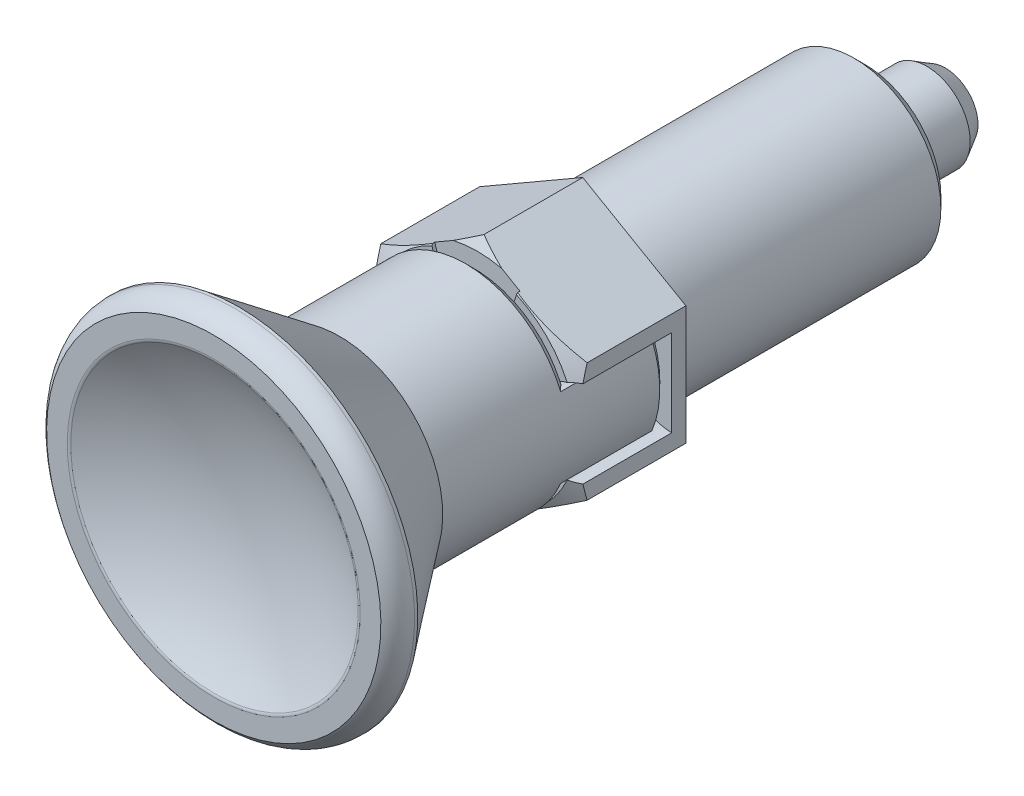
ISO-10303-21;
HEADER;
FILE_DESCRIPTION(('STEP AP214'),'2;1');
FILE_NAME('part.step','',(''),(''),'','','');
FILE_SCHEMA(('AUTOMOTIVE_DESIGN { 1 0 10303 214 1 1 1 1 }'));
ENDSEC;
DATA;
#1=APPLICATION_CONTEXT('core data for automotive mechanical design processes');
#2=APPLICATION_PROTOCOL_DEFINITION('international standard','automotive_design',2000,#1);
#3=PRODUCT_CONTEXT('',#1,'mechanical');
#4=PRODUCT('Part','Part','',(#3));
#5=PRODUCT_RELATED_PRODUCT_CATEGORY('part','',(#4));
#6=PRODUCT_DEFINITION_FORMATION('','',#4);
#7=PRODUCT_DEFINITION_CONTEXT('part definition',#1,'design');
#8=PRODUCT_DEFINITION('design','',#6,#7);
#9=PRODUCT_DEFINITION_SHAPE('','',#8);
#10=(LENGTH_UNIT() NAMED_UNIT(*) SI_UNIT(.MILLI.,.METRE.));
#11=(NAMED_UNIT(*) PLANE_ANGLE_UNIT() SI_UNIT($,.RADIAN.));
#12=(NAMED_UNIT(*) SI_UNIT($,.STERADIAN.) SOLID_ANGLE_UNIT());
#13=UNCERTAINTY_MEASURE_WITH_UNIT(LENGTH_MEASURE(1.E-05),#10,'distance_accuracy_value','');
#14=(GEOMETRIC_REPRESENTATION_CONTEXT(3) GLOBAL_UNCERTAINTY_ASSIGNED_CONTEXT((#13)) GLOBAL_UNIT_ASSIGNED_CONTEXT((#10,
#11,#12)) REPRESENTATION_CONTEXT('',''));
#15=CARTESIAN_POINT('',(0.,0.,0.));
#16=DIRECTION('',(0.,0.,1.));
#17=DIRECTION('',(1.,0.,0.));
#18=AXIS2_PLACEMENT_3D('',#15,#16,#17);
#19=CARTESIAN_POINT('',(5.85947441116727,5.85947441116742,-26.));
#20=DIRECTION('',(0.,0.,-1.));
#21=DIRECTION('',(0.,-1.,0.));
#22=AXIS2_PLACEMENT_3D('',#19,#20,#21);
#23=PLANE('',#22);
#24=CARTESIAN_POINT('',(-1.52655665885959E-13,0.,-26.));
#25=DIRECTION('',(0.,0.,-1.));
#26=DIRECTION('',(0.,-1.,0.));
#27=AXIS2_PLACEMENT_3D('',#24,#25,#26);
#28=CIRCLE('',#27,4.1);
#29=CARTESIAN_POINT('',(-1.52655665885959E-13,-4.09999999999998,-26.));
#30=VERTEX_POINT('',#29);
#31=EDGE_CURVE('E24',#30,#30,#28,.T.);
#32=ORIENTED_EDGE('',*,*,#31,.F.);
#33=EDGE_LOOP('',(#32));
#34=FACE_BOUND('',#33,.T.);
#35=CARTESIAN_POINT('',(0.,0.,-26.));
#36=DIRECTION('',(0.,0.,1.));
#37=DIRECTION('',(1.,0.,0.));
#38=AXIS2_PLACEMENT_3D('',#35,#36,#37);
#39=CIRCLE('',#38,7.);
#40=CARTESIAN_POINT('',(7.,0.,-26.));
#41=VERTEX_POINT('',#40);
#42=EDGE_CURVE('E384',#41,#41,#39,.T.);
#43=ORIENTED_EDGE('',*,*,#42,.F.);
#44=EDGE_LOOP('',(#43));
#45=FACE_BOUND('',#44,.T.);
#46=ADVANCED_FACE('F14',(#34,#45),#23,.T.);
#47=CARTESIAN_POINT('',(-1.52655665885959E-13,0.,-26.2));
#48=DIRECTION('',(0.,0.,-1.));
#49=DIRECTION('',(-1.,0.,0.));
#50=AXIS2_PLACEMENT_3D('',#47,#48,#49);
#51=TOROIDAL_SURFACE('',#50,4.1,0.200000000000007);
#52=ORIENTED_EDGE('',*,*,#31,.T.);
#53=EDGE_LOOP('',(#52));
#54=FACE_BOUND('',#53,.T.);
#55=CARTESIAN_POINT('',(-1.52655665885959E-13,0.,-26.2));
#56=DIRECTION('',(0.,0.,-1.));
#57=DIRECTION('',(0.,-1.,0.));
#58=AXIS2_PLACEMENT_3D('',#55,#56,#57);
#59=CIRCLE('',#58,3.9);
#60=CARTESIAN_POINT('',(-1.52655665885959E-13,-3.89999999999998,-26.2));
#61=VERTEX_POINT('',#60);
#62=EDGE_CURVE('E1409',#61,#61,#59,.T.);
#63=ORIENTED_EDGE('',*,*,#62,.F.);
#64=EDGE_LOOP('',(#63));
#65=FACE_BOUND('',#64,.T.);
#66=ADVANCED_FACE('F2014',(#54,#65),#51,.F.);
#67=CARTESIAN_POINT('',(-1.52655665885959E-13,0.,-26.2));
#68=DIRECTION('',(0.,0.,-1.));
#69=DIRECTION('',(0.,-1.,0.));
#70=AXIS2_PLACEMENT_3D('',#67,#68,#69);
#71=CYLINDRICAL_SURFACE('',#70,3.9);
#72=ORIENTED_EDGE('',*,*,#62,.T.);
#73=EDGE_LOOP('',(#72));
#74=FACE_BOUND('',#73,.T.);
#75=CARTESIAN_POINT('',(-1.52655665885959E-13,0.,-26.2732050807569));
#76=DIRECTION('',(0.,0.,-1.));
#77=DIRECTION('',(0.,-1.,0.));
#78=AXIS2_PLACEMENT_3D('',#75,#76,#77);
#79=CIRCLE('',#78,3.9);
#80=CARTESIAN_POINT('',(-1.50920942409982E-13,-3.89999999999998,-26.2732050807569));
#81=VERTEX_POINT('',#80);
#82=EDGE_CURVE('E1413',#81,#81,#79,.T.);
#83=ORIENTED_EDGE('',*,*,#82,.F.);
#84=EDGE_LOOP('',(#83));
#85=FACE_BOUND('',#84,.T.);
#86=ADVANCED_FACE('F2005',(#74,#85),#71,.T.);
#87=CARTESIAN_POINT('',(-1.52005144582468E-13,0.,-26.2732050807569));
#88=DIRECTION('',(0.,0.,-1.));
#89=DIRECTION('',(-1.,0.,0.));
#90=AXIS2_PLACEMENT_3D('',#87,#88,#89);
#91=TOROIDAL_SURFACE('',#90,4.09999999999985,0.199999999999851);
#92=ORIENTED_EDGE('',*,*,#82,.T.);
#93=EDGE_LOOP('',(#92));
#94=FACE_BOUND('',#93,.T.);
#95=CARTESIAN_POINT('',(-1.52655665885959E-13,0.,-26.3732050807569));
#96=DIRECTION('',(0.,0.,-1.));
#97=DIRECTION('',(0.,-1.,0.));
#98=AXIS2_PLACEMENT_3D('',#95,#96,#97);
#99=CIRCLE('',#98,3.9267949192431);
#100=CARTESIAN_POINT('',(-1.52655665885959E-13,-3.92679491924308,-26.3732050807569));
#101=VERTEX_POINT('',#100);
#102=EDGE_CURVE('E1417',#101,#101,#99,.T.);
#103=ORIENTED_EDGE('',*,*,#102,.F.);
#104=EDGE_LOOP('',(#103));
#105=FACE_BOUND('',#104,.T.);
#106=ADVANCED_FACE('F1996',(#94,#105),#91,.F.);
#107=CARTESIAN_POINT('',(-1.52655665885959E-13,0.,-26.3732050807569));
#108=DIRECTION('',(0.,0.,-1.));
#109=DIRECTION('',(0.,-1.,0.));
#110=AXIS2_PLACEMENT_3D('',#107,#108,#109);
#111=CONICAL_SURFACE('',#110,3.92679491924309,0.523598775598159);
#112=ORIENTED_EDGE('',*,*,#102,.T.);
#113=EDGE_LOOP('',(#112));
#114=FACE_BOUND('',#113,.T.);
#115=CARTESIAN_POINT('',(-1.52655665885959E-13,0.,-26.5));
#116=DIRECTION('',(0.,0.,-1.));
#117=DIRECTION('',(0.,-1.,0.));
#118=AXIS2_PLACEMENT_3D('',#115,#116,#117);
#119=CIRCLE('',#118,4.);
#120=CARTESIAN_POINT('',(-1.52655665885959E-13,-3.99999999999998,-26.5));
#121=VERTEX_POINT('',#120);
#122=EDGE_CURVE('E1421',#121,#121,#119,.T.);
#123=ORIENTED_EDGE('',*,*,#122,.F.);
#124=EDGE_LOOP('',(#123));
#125=FACE_BOUND('',#124,.T.);
#126=ADVANCED_FACE('F1987',(#114,#125),#111,.T.);
#127=CARTESIAN_POINT('',(-1.52655665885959E-13,0.,-26.5));
#128=DIRECTION('',(0.,0.,-1.));
#129=DIRECTION('',(0.,-1.,0.));
#130=AXIS2_PLACEMENT_3D('',#127,#128,#129);
#131=CYLINDRICAL_SURFACE('',#130,4.);
#132=ORIENTED_EDGE('',*,*,#122,.T.);
#133=EDGE_LOOP('',(#132));
#134=FACE_BOUND('',#133,.T.);
#135=CARTESIAN_POINT('',(-1.52655665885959E-13,0.,-31.7));
#136=DIRECTION('',(0.,0.,-1.));
#137=DIRECTION('',(0.,-1.,0.));
#138=AXIS2_PLACEMENT_3D('',#135,#136,#137);
#139=CIRCLE('',#138,4.);
#140=CARTESIAN_POINT('',(-1.52655665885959E-13,-3.99999999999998,-31.7));
#141=VERTEX_POINT('',#140);
#142=EDGE_CURVE('E1425',#141,#141,#139,.T.);
#143=ORIENTED_EDGE('',*,*,#142,.F.);
#144=EDGE_LOOP('',(#143));
#145=FACE_BOUND('',#144,.T.);
#146=ADVANCED_FACE('F1978',(#134,#145),#131,.T.);
#147=CARTESIAN_POINT('',(-1.52655665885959E-13,0.,-33.4113534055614));
#148=DIRECTION('',(0.,0.,1.));
#149=DIRECTION('',(0.,-1.,0.));
#150=AXIS2_PLACEMENT_3D('',#147,#148,#149);
#151=CONICAL_SURFACE('',#150,3.01194965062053,0.523598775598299);
#152=ORIENTED_EDGE('',*,*,#142,.T.);
#153=EDGE_LOOP('',(#152));
#154=FACE_BOUND('',#153,.T.);
#155=CARTESIAN_POINT('',(-1.52655665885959E-13,0.,-33.4113534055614));
#156=DIRECTION('',(0.,0.,-1.));
#157=DIRECTION('',(0.,-1.,0.));
#158=AXIS2_PLACEMENT_3D('',#155,#156,#157);
#159=CIRCLE('',#158,3.01194965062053);
#160=CARTESIAN_POINT('',(-1.52655665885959E-13,-3.01194965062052,-33.4113534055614));
#161=VERTEX_POINT('',#160);
#162=EDGE_CURVE('E1429',#161,#161,#159,.T.);
#163=ORIENTED_EDGE('',*,*,#162,.F.);
#164=EDGE_LOOP('',(#163));
#165=FACE_BOUND('',#164,.T.);
#166=ADVANCED_FACE('F1969',(#154,#165),#151,.T.);
#167=CARTESIAN_POINT('',(-1.52655665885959E-13,0.,-26.));
#168=DIRECTION('',(0.,0.,-1.));
#169=DIRECTION('',(0.,-1.,0.));
#170=AXIS2_PLACEMENT_3D('',#167,#168,#169);
#171=SPHERICAL_SURFACE('',#170,8.0000000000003);
#172=ORIENTED_EDGE('',*,*,#162,.T.);
#173=EDGE_LOOP('',(#172));
#174=FACE_BOUND('',#173,.T.);
#175=ADVANCED_FACE('F1961',(#174),#171,.T.);
#176=CARTESIAN_POINT('',(0.,7.26849136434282E-13,56.303508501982));
#177=DIRECTION('',(0.,0.,-1.));
#178=DIRECTION('',(0.,-1.,0.));
#179=AXIS2_PLACEMENT_3D('',#176,#177,#178);
#180=SPHERICAL_SURFACE('',#179,25.9999999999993);
#181=CARTESIAN_POINT('',(0.,0.,33.9302548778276));
#182=DIRECTION('',(0.,0.,1.));
#183=DIRECTION('',(0.,-1.,0.));
#184=AXIS2_PLACEMENT_3D('',#181,#182,#183);
#185=CIRCLE('',#184,13.2452830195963);
#186=CARTESIAN_POINT('',(0.,-13.2452830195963,33.9302548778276));
#187=VERTEX_POINT('',#186);
#188=EDGE_CURVE('E322',#187,#187,#185,.T.);
#189=ORIENTED_EDGE('',*,*,#188,.T.);
#190=EDGE_LOOP('',(#189));
#191=FACE_BOUND('',#190,.T.);
#192=ADVANCED_FACE('F1953',(#191),#180,.F.);
#193=CARTESIAN_POINT('',(0.,0.,33.5000000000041));
#194=DIRECTION('',(0.,0.,-1.));
#195=DIRECTION('',(-1.,0.,0.));
#196=AXIS2_PLACEMENT_3D('',#193,#194,#195);
#197=TOROIDAL_SURFACE('',#196,13.4999999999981,0.499999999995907);
#198=ORIENTED_EDGE('',*,*,#188,.F.);
#199=EDGE_LOOP('',(#198));
#200=FACE_BOUND('',#199,.T.);
#201=CARTESIAN_POINT('',(0.,0.,34.));
#202=DIRECTION('',(0.,0.,1.));
#203=DIRECTION('',(0.,-1.,0.));
#204=AXIS2_PLACEMENT_3D('',#201,#202,#203);
#205=CIRCLE('',#204,13.5000000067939);
#206=CARTESIAN_POINT('',(0.,-13.5000000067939,34.));
#207=VERTEX_POINT('',#206);
#208=EDGE_CURVE('E318',#207,#207,#205,.T.);
#209=ORIENTED_EDGE('',*,*,#208,.T.);
#210=EDGE_LOOP('',(#209));
#211=FACE_BOUND('',#210,.T.);
#212=ADVANCED_FACE('F1944',(#200,#211),#197,.T.);
#213=CARTESIAN_POINT('',(-16.9399999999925,16.9399999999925,34.));
#214=DIRECTION('',(0.,0.,1.));
#215=DIRECTION('',(0.,-1.,0.));
#216=AXIS2_PLACEMENT_3D('',#213,#214,#215);
#217=PLANE('',#216);
#218=CARTESIAN_POINT('',(0.,0.,34.0000000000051));
#219=DIRECTION('',(0.,0.,1.));
#220=DIRECTION('',(0.,-1.,0.));
#221=AXIS2_PLACEMENT_3D('',#218,#219,#220);
#222=CIRCLE('',#221,15.3999999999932);
#223=CARTESIAN_POINT('',(0.,-15.3999999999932,34.0000000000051));
#224=VERTEX_POINT('',#223);
#225=EDGE_CURVE('E311',#224,#224,#222,.T.);
#226=ORIENTED_EDGE('',*,*,#225,.T.);
#227=EDGE_LOOP('',(#226));
#228=FACE_BOUND('',#227,.T.);
#229=ORIENTED_EDGE('',*,*,#208,.F.);
#230=EDGE_LOOP('',(#229));
#231=FACE_BOUND('',#230,.T.);
#232=ADVANCED_FACE('F1936',(#228,#231),#217,.T.);
#233=CARTESIAN_POINT('',(0.,0.,31.9280692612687));
#234=DIRECTION('',(0.,0.,-1.));
#235=DIRECTION('',(-1.,0.,0.));
#236=AXIS2_PLACEMENT_3D('',#233,#234,#235);
#237=TOROIDAL_SURFACE('',#236,14.0010350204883,2.50000000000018);
#238=ORIENTED_EDGE('',*,*,#225,.F.);
#239=EDGE_LOOP('',(#238));
#240=FACE_BOUND('',#239,.T.);
#241=CARTESIAN_POINT('',(0.,0.,32.));
#242=DIRECTION('',(0.,0.,-1.));
#243=DIRECTION('',(0.,-1.,0.));
#244=AXIS2_PLACEMENT_3D('',#241,#242,#243);
#245=CIRCLE('',#244,16.5);
#246=CARTESIAN_POINT('',(0.,-16.5,32.));
#247=VERTEX_POINT('',#246);
#248=EDGE_CURVE('E306',#247,#247,#245,.T.);
#249=ORIENTED_EDGE('',*,*,#248,.F.);
#250=EDGE_LOOP('',(#249));
#251=FACE_BOUND('',#250,.T.);
#252=ADVANCED_FACE('F16',(#240,#251),#237,.T.);
#253=CARTESIAN_POINT('',(0.,0.,32.));
#254=DIRECTION('',(0.,0.,-1.));
#255=DIRECTION('',(0.,-1.,0.));
#256=AXIS2_PLACEMENT_3D('',#253,#254,#255);
#257=CYLINDRICAL_SURFACE('',#256,16.5);
#258=ORIENTED_EDGE('',*,*,#248,.T.);
#259=EDGE_LOOP('',(#258));
#260=FACE_BOUND('',#259,.T.);
#261=CARTESIAN_POINT('',(0.,0.,31.7));
#262=DIRECTION('',(0.,0.,1.));
#263=DIRECTION('',(0.,-1.,0.));
#264=AXIS2_PLACEMENT_3D('',#261,#262,#263);
#265=CIRCLE('',#264,16.5);
#266=CARTESIAN_POINT('',(0.,-16.5,31.7));
#267=VERTEX_POINT('',#266);
#268=EDGE_CURVE('E307',#267,#267,#265,.T.);
#269=ORIENTED_EDGE('',*,*,#268,.T.);
#270=EDGE_LOOP('',(#269));
#271=FACE_BOUND('',#270,.T.);
#272=ADVANCED_FACE('F1919',(#260,#271),#257,.T.);
#273=CARTESIAN_POINT('',(12.65,12.65,0.));
#274=DIRECTION('',(0.,0.,-1.));
#275=DIRECTION('',(0.,-1.,0.));
#276=AXIS2_PLACEMENT_3D('',#273,#274,#275);
#277=PLANE('',#276);
#278=DIRECTION('',(0.,1.,0.));
#279=VECTOR('',#278,1.);
#280=CARTESIAN_POINT('',(-9.50246374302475,-5.48625,0.));
#281=LINE('',#280,#279);
#282=CARTESIAN_POINT('',(-9.50246374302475,-5.48625,0.));
#283=VERTEX_POINT('',#282);
#284=CARTESIAN_POINT('',(-9.50246374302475,5.48625,0.));
#285=VERTEX_POINT('',#284);
#286=EDGE_CURVE('E389',#283,#285,#281,.T.);
#287=ORIENTED_EDGE('',*,*,#286,.T.);
#288=DIRECTION('',(0.866025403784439,0.5,0.));
#289=VECTOR('',#288,1.);
#290=CARTESIAN_POINT('',(-9.50246374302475,5.48625,0.));
#291=LINE('',#290,#289);
#292=CARTESIAN_POINT('',(0.,10.9725,0.));
#293=VERTEX_POINT('',#292);
#294=EDGE_CURVE('E403',#285,#293,#291,.T.);
#295=ORIENTED_EDGE('',*,*,#294,.T.);
#296=DIRECTION('',(0.866025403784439,-0.5,0.));
#297=VECTOR('',#296,1.);
#298=CARTESIAN_POINT('',(0.,10.9725,0.));
#299=LINE('',#298,#297);
#300=CARTESIAN_POINT('',(9.50246374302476,5.48625,0.));
#301=VERTEX_POINT('',#300);
#302=EDGE_CURVE('E407',#293,#301,#299,.T.);
#303=ORIENTED_EDGE('',*,*,#302,.T.);
#304=DIRECTION('',(0.,-1.,0.));
#305=VECTOR('',#304,1.);
#306=CARTESIAN_POINT('',(9.50246374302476,5.48625,0.));
#307=LINE('',#306,#305);
#308=CARTESIAN_POINT('',(9.50246374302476,-5.48625,0.));
#309=VERTEX_POINT('',#308);
#310=EDGE_CURVE('E411',#301,#309,#307,.T.);
#311=ORIENTED_EDGE('',*,*,#310,.T.);
#312=DIRECTION('',(-0.866025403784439,-0.5,0.));
#313=VECTOR('',#312,1.);
#314=CARTESIAN_POINT('',(9.50246374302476,-5.48625,0.));
#315=LINE('',#314,#313);
#316=CARTESIAN_POINT('',(0.,-10.9725,0.));
#317=VERTEX_POINT('',#316);
#318=EDGE_CURVE('E415',#309,#317,#315,.T.);
#319=ORIENTED_EDGE('',*,*,#318,.T.);
#320=DIRECTION('',(-0.866025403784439,0.5,0.));
#321=VECTOR('',#320,1.);
#322=CARTESIAN_POINT('',(0.,-10.9725,0.));
#323=LINE('',#322,#321);
#324=EDGE_CURVE('E398',#317,#283,#323,.T.);
#325=ORIENTED_EDGE('',*,*,#324,.T.);
#326=EDGE_LOOP('',(#287,#295,#303,#311,#319,#325));
#327=FACE_BOUND('',#326,.T.);
#328=CARTESIAN_POINT('',(0.,0.,0.));
#329=DIRECTION('',(0.,0.,1.));
#330=DIRECTION('',(1.,0.,0.));
#331=AXIS2_PLACEMENT_3D('',#328,#329,#330);
#332=CIRCLE('',#331,8.);
#333=CARTESIAN_POINT('',(8.,0.,0.));
#334=VERTEX_POINT('',#333);
#335=EDGE_CURVE('E394',#334,#334,#332,.T.);
#336=ORIENTED_EDGE('',*,*,#335,.T.);
#337=EDGE_LOOP('',(#336));
#338=FACE_BOUND('',#337,.T.);
#339=ADVANCED_FACE('F1910',(#327,#338),#277,.T.);
#340=CARTESIAN_POINT('',(0.,0.,22.4));
#341=DIRECTION('',(0.,0.,1.));
#342=DIRECTION('',(0.,-1.,0.));
#343=AXIS2_PLACEMENT_3D('',#340,#341,#342);
#344=CONICAL_SURFACE('',#343,9.5,0.645219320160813);
#345=ORIENTED_EDGE('',*,*,#268,.F.);
#346=EDGE_LOOP('',(#345));
#347=FACE_BOUND('',#346,.T.);
#348=CARTESIAN_POINT('',(0.,0.,22.4));
#349=DIRECTION('',(0.,0.,1.));
#350=DIRECTION('',(0.,-1.,0.));
#351=AXIS2_PLACEMENT_3D('',#348,#349,#350);
#352=CIRCLE('',#351,9.5);
#353=CARTESIAN_POINT('',(0.,-9.49999999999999,22.4));
#354=VERTEX_POINT('',#353);
#355=EDGE_CURVE('E301',#354,#354,#352,.T.);
#356=ORIENTED_EDGE('',*,*,#355,.T.);
#357=EDGE_LOOP('',(#356));
#358=FACE_BOUND('',#357,.T.);
#359=ADVANCED_FACE('F1903',(#347,#358),#344,.T.);
#360=CARTESIAN_POINT('',(-9.50246374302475,5.48625,10.));
#361=DIRECTION('',(1.,0.,0.));
#362=DIRECTION('',(0.,-1.,0.));
#363=AXIS2_PLACEMENT_3D('',#360,#361,#362);
#364=PLANE('',#363);
#365=CARTESIAN_POINT('',(-9.50246374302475,5.48625,9.1));
#366=CARTESIAN_POINT('',(-9.50246374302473,4.71999321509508,9.32119928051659));
#367=CARTESIAN_POINT('',(-9.50246374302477,3.99999924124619,9.48247464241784));
#368=(BOUNDED_CURVE() B_SPLINE_CURVE(2,(#365,#366,#367),.UNSPECIFIED.,.F.,
.F.) B_SPLINE_CURVE_WITH_KNOTS((3,3),(0.,0.123263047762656),
.UNSPECIFIED.) CURVE() GEOMETRIC_REPRESENTATION_ITEM() RATIONAL_B_SPLINE_CURVE((1.,
1.01906885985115,1.03343674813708)) REPRESENTATION_ITEM(''));
#369=CARTESIAN_POINT('',(-9.50246374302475,5.48625,9.1));
#370=VERTEX_POINT('',#369);
#371=CARTESIAN_POINT('',(-9.50246374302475,3.9999992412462,9.48247464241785));
#372=VERTEX_POINT('',#371);
#373=EDGE_CURVE('E635',#370,#372,#368,.T.);
#374=ORIENTED_EDGE('',*,*,#373,.F.);
#375=DIRECTION('',(0.,0.,1.));
#376=VECTOR('',#375,1.);
#377=CARTESIAN_POINT('',(-9.50246374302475,5.48625,0.));
#378=LINE('',#377,#376);
#379=EDGE_CURVE('E422',#285,#370,#378,.T.);
#380=ORIENTED_EDGE('',*,*,#379,.F.);
#381=ORIENTED_EDGE('',*,*,#286,.F.);
#382=DIRECTION('',(0.,0.,-1.));
#383=VECTOR('',#382,1.);
#384=CARTESIAN_POINT('',(-9.50246374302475,-5.48625,9.1));
#385=LINE('',#384,#383);
#386=CARTESIAN_POINT('',(-9.50246374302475,-5.48625,9.1));
#387=VERTEX_POINT('',#386);
#388=EDGE_CURVE('E428',#387,#283,#385,.T.);
#389=ORIENTED_EDGE('',*,*,#388,.F.);
#390=CARTESIAN_POINT('',(-9.50246374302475,-4.,9.48247447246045));
#391=CARTESIAN_POINT('',(-9.50246374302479,-4.71999361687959,9.32119916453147));
#392=CARTESIAN_POINT('',(-9.50246374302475,-5.48625,9.1));
#393=(BOUNDED_CURVE() B_SPLINE_CURVE(2,(#390,#391,#392),.UNSPECIFIED.,.F.,
.F.) B_SPLINE_CURVE_WITH_KNOTS((3,3),(0.876737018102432,1.),
.UNSPECIFIED.) CURVE() GEOMETRIC_REPRESENTATION_ITEM() RATIONAL_B_SPLINE_CURVE((1.03343673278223,
1.01906884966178,1.)) REPRESENTATION_ITEM(''));
#394=CARTESIAN_POINT('',(-9.50123187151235,-4.,9.48247447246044));
#395=VERTEX_POINT('',#394);
#396=EDGE_CURVE('E522',#395,#387,#393,.T.);
#397=ORIENTED_EDGE('',*,*,#396,.F.);
#398=DIRECTION('',(0.,0.,-1.));
#399=VECTOR('',#398,1.);
#400=CARTESIAN_POINT('',(-9.50246374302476,-4.,10.));
#401=LINE('',#400,#399);
#402=CARTESIAN_POINT('',(-9.50246374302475,-3.9999996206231,1.3));
#403=VERTEX_POINT('',#402);
#404=EDGE_CURVE('E399',#395,#403,#401,.T.);
#405=ORIENTED_EDGE('',*,*,#404,.T.);
#406=DIRECTION('',(0.,1.,0.));
#407=VECTOR('',#406,1.);
#408=CARTESIAN_POINT('',(-9.50246374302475,-3.99999924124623,1.3));
#409=LINE('',#408,#407);
#410=CARTESIAN_POINT('',(-9.50246374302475,3.9999992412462,1.3));
#411=VERTEX_POINT('',#410);
#412=EDGE_CURVE('E623',#403,#411,#409,.T.);
#413=ORIENTED_EDGE('',*,*,#412,.T.);
#414=DIRECTION('',(0.,0.,1.));
#415=VECTOR('',#414,1.);
#416=CARTESIAN_POINT('',(-9.50246374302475,3.9999992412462,1.3));
#417=LINE('',#416,#415);
#418=EDGE_CURVE('E62',#411,#372,#417,.T.);
#419=ORIENTED_EDGE('',*,*,#418,.T.);
#420=EDGE_LOOP('',(#374,#380,#381,#389,#397,#405,#413,#419));
#421=FACE_BOUND('',#420,.T.);
#422=ADVANCED_FACE('F1895',(#421),#364,.F.);
#423=CARTESIAN_POINT('',(0.,0.,10.));
#424=DIRECTION('',(0.,0.,-1.));
#425=DIRECTION('',(0.,-1.,0.));
#426=AXIS2_PLACEMENT_3D('',#423,#424,#425);
#427=CONICAL_SURFACE('',#426,9.41365427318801,1.0471975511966);
#428=CARTESIAN_POINT('',(0.,10.9725,9.1));
#429=CARTESIAN_POINT('',(1.17844932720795,10.2921219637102,9.49281644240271));
#430=CARTESIAN_POINT('',(2.24528503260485,9.67618408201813,9.69999999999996));
#431=(BOUNDED_CURVE() B_SPLINE_CURVE(2,(#428,#429,#430),.UNSPECIFIED.,.F.,
.F.) B_SPLINE_CURVE_WITH_KNOTS((3,3),(0.77781637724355,1.),
.UNSPECIFIED.) CURVE() GEOMETRIC_REPRESENTATION_ITEM() RATIONAL_B_SPLINE_CURVE((1.,
1.03437192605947,1.05347009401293)) REPRESENTATION_ITEM(''));
#432=CARTESIAN_POINT('',(0.,10.9725,9.1));
#433=VERTEX_POINT('',#432);
#434=CARTESIAN_POINT('',(2.24528503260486,9.67618408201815,9.7));
#435=VERTEX_POINT('',#434);
#436=EDGE_CURVE('E577',#433,#435,#431,.T.);
#437=ORIENTED_EDGE('',*,*,#436,.F.);
#438=CARTESIAN_POINT('',(-2.2452850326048,9.67618408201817,9.70000000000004));
#439=CARTESIAN_POINT('',(-1.17844932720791,10.2921219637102,9.49281644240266));
#440=CARTESIAN_POINT('',(0.,10.9725,9.1));
#441=(BOUNDED_CURVE() B_SPLINE_CURVE(2,(#438,#439,#440),.UNSPECIFIED.,.F.,
.F.) B_SPLINE_CURVE_WITH_KNOTS((3,3),(0.,0.222183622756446),
.UNSPECIFIED.) CURVE() GEOMETRIC_REPRESENTATION_ITEM() RATIONAL_B_SPLINE_CURVE((1.05347009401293,
1.03437192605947,1.)) REPRESENTATION_ITEM(''));
#442=CARTESIAN_POINT('',(-2.2452850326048,9.6761840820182,9.7));
#443=VERTEX_POINT('',#442);
#444=EDGE_CURVE('E590',#443,#433,#441,.T.);
#445=ORIENTED_EDGE('',*,*,#444,.F.);
#446=CARTESIAN_POINT('',(0.,-1.38777878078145E-13,9.7));
#447=DIRECTION('',(0.,0.,1.));
#448=DIRECTION('',(0.226036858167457,0.974118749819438,0.));
#449=AXIS2_PLACEMENT_3D('',#446,#447,#448);
#450=CIRCLE('',#449,9.93326951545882);
#451=EDGE_CURVE('E601',#435,#443,#450,.T.);
#452=ORIENTED_EDGE('',*,*,#451,.F.);
#453=EDGE_LOOP('',(#437,#445,#452));
#454=FACE_BOUND('',#453,.T.);
#455=ADVANCED_FACE('F1828',(#454),#427,.T.);
#456=CARTESIAN_POINT('',(-9.57194140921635,9.57194140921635,10.));
#457=DIRECTION('',(0.,0.,1.));
#458=DIRECTION('',(0.,-1.,0.));
#459=AXIS2_PLACEMENT_3D('',#456,#457,#458);
#460=PLANE('',#459);
#461=CARTESIAN_POINT('',(0.,0.,10.));
#462=DIRECTION('',(0.,0.,1.));
#463=DIRECTION('',(0.,1.,0.));
#464=AXIS2_PLACEMENT_3D('',#461,#462,#463);
#465=CIRCLE('',#464,8.7);
#466=CARTESIAN_POINT('',(-3.66237378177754,7.89157894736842,10.));
#467=VERTEX_POINT('',#466);
#468=CARTESIAN_POINT('',(-7.89157894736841,3.66237378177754,10.));
#469=VERTEX_POINT('',#468);
#470=EDGE_CURVE('E1372',#467,#469,#465,.T.);
#471=ORIENTED_EDGE('',*,*,#470,.F.);
#472=CARTESIAN_POINT('',(0.,9.5,10.));
#473=DIRECTION('',(0.,0.,-1.));
#474=DIRECTION('',(0.,-1.,0.));
#475=AXIS2_PLACEMENT_3D('',#472,#473,#474);
#476=CIRCLE('',#475,4.);
#477=CARTESIAN_POINT('',(-3.89084916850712,8.57194140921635,10.));
#478=VERTEX_POINT('',#477);
#479=EDGE_CURVE('E450',#467,#478,#476,.T.);
#480=ORIENTED_EDGE('',*,*,#479,.T.);
#481=CARTESIAN_POINT('',(0.,0.,10.));
#482=DIRECTION('',(0.,0.,1.));
#483=DIRECTION('',(-0.413319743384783,0.91058595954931,0.));
#484=AXIS2_PLACEMENT_3D('',#481,#482,#483);
#485=CIRCLE('',#484,9.41365427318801);
#486=CARTESIAN_POINT('',(-8.57194140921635,3.89084916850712,10.));
#487=VERTEX_POINT('',#486);
#488=EDGE_CURVE('E457',#478,#487,#485,.T.);
#489=ORIENTED_EDGE('',*,*,#488,.T.);
#490=CARTESIAN_POINT('',(-9.5,0.,10.));
#491=DIRECTION('',(0.,0.,-1.));
#492=DIRECTION('',(0.23201464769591,0.972712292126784,0.));
#493=AXIS2_PLACEMENT_3D('',#490,#491,#492);
#494=CIRCLE('',#493,4.);
#495=EDGE_CURVE('E1379',#487,#469,#494,.T.);
#496=ORIENTED_EDGE('',*,*,#495,.T.);
#497=EDGE_LOOP('',(#471,#480,#489,#496));
#498=FACE_BOUND('',#497,.T.);
#499=ADVANCED_FACE('F704',(#498),#460,.T.);
#500=CARTESIAN_POINT('',(-9.50246374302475,5.48625,9.1));
#501=CARTESIAN_POINT('',(-6.5183737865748,7.20911513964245,10.09469665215));
#502=CARTESIAN_POINT('',(-3.92095642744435,8.70873475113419,9.92087389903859));
#503=(BOUNDED_CURVE() B_SPLINE_CURVE(2,(#500,#501,#502),.UNSPECIFIED.,.F.,
.F.) B_SPLINE_CURVE_WITH_KNOTS((3,3),(0.406105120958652,1.),
.UNSPECIFIED.) CURVE() GEOMETRIC_REPRESENTATION_ITEM() RATIONAL_B_SPLINE_CURVE((1.,
1.09187585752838,1.07462251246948)) REPRESENTATION_ITEM(''));
#504=CARTESIAN_POINT('',(-3.92095642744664,8.70873475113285,9.92087389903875));
#505=VERTEX_POINT('',#504);
#506=EDGE_CURVE('E427',#370,#505,#503,.T.);
#507=ORIENTED_EDGE('',*,*,#506,.F.);
#508=ORIENTED_EDGE('',*,*,#373,.T.);
#509=CARTESIAN_POINT('',(-9.50246374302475,3.9999992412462,9.48247464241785));
#510=CARTESIAN_POINT('',(-9.46176693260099,4.00002390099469,9.50412495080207));
#511=CARTESIAN_POINT('',(-9.42111823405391,3.99943408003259,9.52586639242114));
#512=CARTESIAN_POINT('',(-9.34036021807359,3.99703931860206,9.56930061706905));
#513=CARTESIAN_POINT('',(-9.3002496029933,3.99524672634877,9.59099166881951));
#514=CARTESIAN_POINT('',(-9.22056798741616,3.99048337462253,9.63432503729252));
#515=CARTESIAN_POINT('',(-9.18099548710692,3.98752400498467,9.65596584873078));
#516=CARTESIAN_POINT('',(-9.10238890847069,3.98046430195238,9.69919846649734));
#517=CARTESIAN_POINT('',(-9.06335318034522,3.97637441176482,9.72078897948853));
#518=CARTESIAN_POINT('',(-8.98581773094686,3.96709001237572,9.76392080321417));
#519=CARTESIAN_POINT('',(-8.94731625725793,3.96190502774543,9.78546101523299));
#520=CARTESIAN_POINT('',(-8.87084565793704,3.95046627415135,9.82849203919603));
#521=CARTESIAN_POINT('',(-8.83287472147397,3.9442211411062,9.84998192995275));
#522=CARTESIAN_POINT('',(-8.75746051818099,3.9306970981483,9.89291214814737));
#523=CARTESIAN_POINT('',(-8.72001542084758,3.92342597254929,9.91435171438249));
#524=CARTESIAN_POINT('',(-8.64564666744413,3.90788503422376,9.95718108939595));
#525=CARTESIAN_POINT('',(-8.60872119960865,3.89962218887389,9.97857027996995));
#526=CARTESIAN_POINT('',(-8.57194140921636,3.89084916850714,10.));
#527=B_SPLINE_CURVE_WITH_KNOTS('',3,(#509,#510,#511,#512,#513,#514,#515,#516,#517,#518,#519,
#520,#521,#522,#523,#524,#525,#526),.UNSPECIFIED.,.F.,.F.,(4,2,2,2,2,2,2,2,4),(0.,
0.138287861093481,0.275177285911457,0.410762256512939,0.545134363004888,0.678382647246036,
0.810593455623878,0.941850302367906,1.07223374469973),.UNSPECIFIED.);
#528=EDGE_CURVE('E469',#372,#487,#527,.T.);
#529=ORIENTED_EDGE('',*,*,#528,.T.);
#530=ORIENTED_EDGE('',*,*,#488,.F.);
#531=CARTESIAN_POINT('',(-3.92095642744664,8.70873475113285,9.92087389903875));
#532=CARTESIAN_POINT('',(-3.9117026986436,8.6628820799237,9.94720612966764));
#533=CARTESIAN_POINT('',(-3.9016763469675,8.61733392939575,9.97355223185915));
#534=CARTESIAN_POINT('',(-3.89084916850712,8.57194140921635,10.));
#535=B_SPLINE_CURVE_WITH_KNOTS('',3,(#531,#532,#533,#534),.UNSPECIFIED.,.F.,.F.,(4,4),(0.,
0.261482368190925),.UNSPECIFIED.);
#536=EDGE_CURVE('E439',#505,#478,#535,.T.);
#537=ORIENTED_EDGE('',*,*,#536,.F.);
#538=EDGE_LOOP('',(#507,#508,#529,#530,#537));
#539=FACE_BOUND('',#538,.T.);
#540=ADVANCED_FACE('F693',(#539),#427,.T.);
#541=CARTESIAN_POINT('',(0.,10.9725,10.));
#542=DIRECTION('',(0.5,-0.866025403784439,0.));
#543=DIRECTION('',(-0.866025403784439,-0.5,0.));
#544=AXIS2_PLACEMENT_3D('',#541,#542,#543);
#545=PLANE('',#544);
#546=DIRECTION('',(-0.866025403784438,-0.5,0.));
#547=VECTOR('',#546,1.);
#548=CARTESIAN_POINT('',(-2.24528503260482,9.67618408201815,9.7));
#549=LINE('',#548,#547);
#550=CARTESIAN_POINT('',(-3.92095642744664,8.70873475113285,9.7));
#551=VERTEX_POINT('',#550);
#552=EDGE_CURVE('E438',#443,#551,#549,.T.);
#553=ORIENTED_EDGE('',*,*,#552,.F.);
#554=ORIENTED_EDGE('',*,*,#444,.T.);
#555=DIRECTION('',(0.,0.,-1.));
#556=VECTOR('',#555,1.);
#557=CARTESIAN_POINT('',(0.,10.9725,9.1));
#558=LINE('',#557,#556);
#559=EDGE_CURVE('E426',#433,#293,#558,.T.);
#560=ORIENTED_EDGE('',*,*,#559,.T.);
#561=ORIENTED_EDGE('',*,*,#294,.F.);
#562=ORIENTED_EDGE('',*,*,#379,.T.);
#563=ORIENTED_EDGE('',*,*,#506,.T.);
#564=DIRECTION('',(0.,0.,1.));
#565=VECTOR('',#564,1.);
#566=CARTESIAN_POINT('',(-3.92095642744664,8.70873475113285,9.7));
#567=LINE('',#566,#565);
#568=EDGE_CURVE('E448',#551,#505,#567,.T.);
#569=ORIENTED_EDGE('',*,*,#568,.F.);
#570=EDGE_LOOP('',(#553,#554,#560,#561,#562,#563,#569));
#571=FACE_BOUND('',#570,.T.);
#572=ADVANCED_FACE('F703',(#571),#545,.F.);
#573=CARTESIAN_POINT('',(9.50246374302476,5.48625,10.));
#574=DIRECTION('',(-0.5,-0.866025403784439,0.));
#575=DIRECTION('',(-0.866025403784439,0.5,0.));
#576=AXIS2_PLACEMENT_3D('',#573,#574,#575);
#577=PLANE('',#576);
#578=CARTESIAN_POINT('',(3.92095642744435,8.70873475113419,9.92087389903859));
#579=CARTESIAN_POINT('',(6.51837378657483,7.2091151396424,10.09469665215));
#580=CARTESIAN_POINT('',(9.50246374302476,5.48625,9.1));
#581=(BOUNDED_CURVE() B_SPLINE_CURVE(2,(#578,#579,#580),.UNSPECIFIED.,.F.,
.F.) B_SPLINE_CURVE_WITH_KNOTS((3,3),(0.,0.593894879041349),
.UNSPECIFIED.) CURVE() GEOMETRIC_REPRESENTATION_ITEM() RATIONAL_B_SPLINE_CURVE((1.07462251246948,
1.09187585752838,1.)) REPRESENTATION_ITEM(''));
#582=CARTESIAN_POINT('',(3.92095642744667,8.70873475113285,9.92087389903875));
#583=VERTEX_POINT('',#582);
#584=CARTESIAN_POINT('',(9.50246374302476,5.48625,9.1));
#585=VERTEX_POINT('',#584);
#586=EDGE_CURVE('E576',#583,#585,#581,.T.);
#587=ORIENTED_EDGE('',*,*,#586,.T.);
#588=DIRECTION('',(0.,0.,-1.));
#589=VECTOR('',#588,1.);
#590=CARTESIAN_POINT('',(9.50246374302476,5.48625,9.1));
#591=LINE('',#590,#589);
#592=EDGE_CURVE('E572',#585,#301,#591,.T.);
#593=ORIENTED_EDGE('',*,*,#592,.T.);
#594=ORIENTED_EDGE('',*,*,#302,.F.);
#595=ORIENTED_EDGE('',*,*,#559,.F.);
#596=ORIENTED_EDGE('',*,*,#436,.T.);
#597=DIRECTION('',(-0.866025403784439,0.5,0.));
#598=VECTOR('',#597,1.);
#599=CARTESIAN_POINT('',(3.92095642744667,8.70873475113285,9.7));
#600=LINE('',#599,#598);
#601=CARTESIAN_POINT('',(3.92095642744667,8.70873475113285,9.7));
#602=VERTEX_POINT('',#601);
#603=EDGE_CURVE('E291',#602,#435,#600,.T.);
#604=ORIENTED_EDGE('',*,*,#603,.F.);
#605=DIRECTION('',(0.,0.,-1.));
#606=VECTOR('',#605,1.);
#607=CARTESIAN_POINT('',(3.92095642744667,8.70873475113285,9.92087389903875));
#608=LINE('',#607,#606);
#609=EDGE_CURVE('E288',#583,#602,#608,.T.);
#610=ORIENTED_EDGE('',*,*,#609,.F.);
#611=EDGE_LOOP('',(#587,#593,#594,#595,#596,#604,#610));
#612=FACE_BOUND('',#611,.T.);
#613=ADVANCED_FACE('F761',(#612),#577,.F.);
#614=CARTESIAN_POINT('',(7.89157894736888,3.66237378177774,10.));
#615=VERTEX_POINT('',#614);
#616=CARTESIAN_POINT('',(3.66237378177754,7.89157894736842,10.));
#617=VERTEX_POINT('',#616);
#618=EDGE_CURVE('E1405',#615,#617,#465,.T.);
#619=ORIENTED_EDGE('',*,*,#618,.F.);
#620=CARTESIAN_POINT('',(9.5,0.,10.));
#621=DIRECTION('',(0.,0.,-1.));
#622=DIRECTION('',(-0.232014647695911,-0.972712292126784,0.));
#623=AXIS2_PLACEMENT_3D('',#620,#621,#622);
#624=CIRCLE('',#623,4.);
#625=CARTESIAN_POINT('',(8.57194140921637,3.89084916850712,10.));
#626=VERTEX_POINT('',#625);
#627=EDGE_CURVE('E785',#615,#626,#624,.T.);
#628=ORIENTED_EDGE('',*,*,#627,.T.);
#629=CARTESIAN_POINT('',(-3.00107161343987E-13,-1.38777878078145E-13,10.000000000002));
#630=DIRECTION('',(1.95211669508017E-13,0.,1.));
#631=DIRECTION('',(0.910585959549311,0.413319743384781,-2.12287533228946E-13));
#632=AXIS2_PLACEMENT_3D('',#629,#630,#631);
#633=CIRCLE('',#632,9.41365427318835);
#634=CARTESIAN_POINT('',(3.89084916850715,8.57194140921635,10.));
#635=VERTEX_POINT('',#634);
#636=EDGE_CURVE('E462',#626,#635,#633,.T.);
#637=ORIENTED_EDGE('',*,*,#636,.T.);
#638=CARTESIAN_POINT('',(0.,9.5,10.));
#639=DIRECTION('',(0.,0.,-1.));
#640=DIRECTION('',(0.972712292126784,-0.232014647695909,0.));
#641=AXIS2_PLACEMENT_3D('',#638,#639,#640);
#642=CIRCLE('',#641,4.);
#643=EDGE_CURVE('E458',#635,#617,#642,.T.);
#644=ORIENTED_EDGE('',*,*,#643,.T.);
#645=EDGE_LOOP('',(#619,#628,#637,#644));
#646=FACE_BOUND('',#645,.T.);
#647=ADVANCED_FACE('F1835',(#646),#460,.T.);
#648=ORIENTED_EDGE('',*,*,#636,.F.);
#649=CARTESIAN_POINT('',(8.57194140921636,3.89084916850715,10.));
#650=CARTESIAN_POINT('',(8.60872107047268,3.89962215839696,9.97857035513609));
#651=CARTESIAN_POINT('',(8.64564640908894,3.90788497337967,9.95718123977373));
#652=CARTESIAN_POINT('',(8.72001494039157,3.92342586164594,9.91435199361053));
#653=CARTESIAN_POINT('',(8.75745994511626,3.93069696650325,9.89291248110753));
#654=CARTESIAN_POINT('',(8.83287399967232,3.94422097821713,9.84998234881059));
#655=CARTESIAN_POINT('',(8.87084488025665,3.95046609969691,9.82849249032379));
#656=CARTESIAN_POINT('',(8.94731540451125,3.96190483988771,9.78546150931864));
#657=CARTESIAN_POINT('',(8.98581685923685,3.96708982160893,9.76392130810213));
#658=CARTESIAN_POINT('',(9.06335230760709,3.976374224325,9.72078948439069));
#659=CARTESIAN_POINT('',(9.10238805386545,3.98046411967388,9.6991989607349));
#660=CARTESIAN_POINT('',(9.18099470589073,3.98752384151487,9.65596630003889));
#661=CARTESIAN_POINT('',(9.22056726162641,3.99048322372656,9.63432545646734));
#662=CARTESIAN_POINT('',(9.30024902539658,3.99524660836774,9.5909920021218));
#663=CARTESIAN_POINT('',(9.34035973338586,3.99703921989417,9.56930089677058));
#664=CARTESIAN_POINT('',(9.42111797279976,3.99943402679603,9.52586654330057));
#665=CARTESIAN_POINT('',(9.46176680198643,4.0000238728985,9.50412502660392));
#666=CARTESIAN_POINT('',(9.50246374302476,3.99999924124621,9.48247464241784));
#667=B_SPLINE_CURVE_WITH_KNOTS('',3,(#649,#650,#651,#652,#653,#654,#655,#656,#657,#658,#659,
#660,#661,#662,#663,#664,#665,#666),.UNSPECIFIED.,.F.,.F.,(4,2,2,2,2,2,2,2,4),(0.,
0.130382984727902,0.261639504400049,0.393850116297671,0.527098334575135,0.661470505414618,
0.797055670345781,0.933945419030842,1.07223373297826),.UNSPECIFIED.);
#668=CARTESIAN_POINT('',(9.50246374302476,3.9999992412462,9.48247464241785));
#669=VERTEX_POINT('',#668);
#670=EDGE_CURVE('E652',#626,#669,#667,.T.);
#671=ORIENTED_EDGE('',*,*,#670,.T.);
#672=CARTESIAN_POINT('',(9.50246374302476,3.99999924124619,9.48247464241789));
#673=CARTESIAN_POINT('',(9.50246374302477,4.71999321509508,9.32119928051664));
#674=CARTESIAN_POINT('',(9.50246374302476,5.48625,9.1));
#675=(BOUNDED_CURVE() B_SPLINE_CURVE(2,(#672,#673,#674),.UNSPECIFIED.,.F.,
.F.) B_SPLINE_CURVE_WITH_KNOTS((3,3),(0.876736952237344,1.),
.UNSPECIFIED.) CURVE() GEOMETRIC_REPRESENTATION_ITEM() RATIONAL_B_SPLINE_CURVE((1.03343674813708,
1.01906885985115,1.)) REPRESENTATION_ITEM(''));
#676=EDGE_CURVE('E583',#669,#585,#675,.T.);
#677=ORIENTED_EDGE('',*,*,#676,.T.);
#678=ORIENTED_EDGE('',*,*,#586,.F.);
#679=CARTESIAN_POINT('',(3.89084916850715,8.57194140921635,10.));
#680=CARTESIAN_POINT('',(3.90167517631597,8.61732902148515,9.9735550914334));
#681=CARTESIAN_POINT('',(3.91170339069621,8.6628852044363,9.94720431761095));
#682=CARTESIAN_POINT('',(3.92095642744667,8.70873475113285,9.92087389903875));
#683=B_SPLINE_CURVE_WITH_KNOTS('',3,(#679,#680,#681,#682),.UNSPECIFIED.,.F.,.F.,(4,4),
(0.738448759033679,1.),.UNSPECIFIED.);
#684=EDGE_CURVE('E464',#635,#583,#683,.T.);
#685=ORIENTED_EDGE('',*,*,#684,.F.);
#686=EDGE_LOOP('',(#648,#671,#677,#678,#685));
#687=FACE_BOUND('',#686,.T.);
#688=ADVANCED_FACE('F1843',(#687),#427,.T.);
#689=CARTESIAN_POINT('',(9.50246374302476,-5.48625,10.));
#690=DIRECTION('',(-1.,0.,0.));
#691=DIRECTION('',(0.,1.,0.));
#692=AXIS2_PLACEMENT_3D('',#689,#690,#691);
#693=PLANE('',#692);
#694=DIRECTION('',(0.,-1.,0.));
#695=VECTOR('',#694,1.);
#696=CARTESIAN_POINT('',(9.50246374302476,3.9999992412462,1.3));
#697=LINE('',#696,#695);
#698=CARTESIAN_POINT('',(9.50246374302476,3.9999992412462,1.3));
#699=VERTEX_POINT('',#698);
#700=CARTESIAN_POINT('',(9.50246374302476,-3.9999996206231,1.3));
#701=VERTEX_POINT('',#700);
#702=EDGE_CURVE('E544',#699,#701,#697,.T.);
#703=ORIENTED_EDGE('',*,*,#702,.T.);
#704=DIRECTION('',(0.,0.,-1.));
#705=VECTOR('',#704,1.);
#706=CARTESIAN_POINT('',(9.50246374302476,-4.,10.));
#707=LINE('',#706,#705);
#708=CARTESIAN_POINT('',(9.50123187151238,-4.,9.48247447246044));
#709=VERTEX_POINT('',#708);
#710=EDGE_CURVE('E639',#701,#709,#707,.F.);
#711=ORIENTED_EDGE('',*,*,#710,.T.);
#712=CARTESIAN_POINT('',(9.50246374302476,-5.48625,9.1));
#713=CARTESIAN_POINT('',(9.50246374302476,-4.7199936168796,9.32119916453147));
#714=CARTESIAN_POINT('',(9.50246374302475,-4.00000000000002,9.48247447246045));
#715=(BOUNDED_CURVE() B_SPLINE_CURVE(2,(#712,#713,#714),.UNSPECIFIED.,.F.,
.F.) B_SPLINE_CURVE_WITH_KNOTS((3,3),(0.,0.123262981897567),
.UNSPECIFIED.) CURVE() GEOMETRIC_REPRESENTATION_ITEM() RATIONAL_B_SPLINE_CURVE((1.,
1.01906884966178,1.03343673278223)) REPRESENTATION_ITEM(''));
#716=CARTESIAN_POINT('',(9.50246374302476,-5.48625,9.1));
#717=VERTEX_POINT('',#716);
#718=EDGE_CURVE('E615',#717,#709,#715,.T.);
#719=ORIENTED_EDGE('',*,*,#718,.F.);
#720=DIRECTION('',(0.,0.,1.));
#721=VECTOR('',#720,1.);
#722=CARTESIAN_POINT('',(9.50246374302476,-5.48625,0.));
#723=LINE('',#722,#721);
#724=EDGE_CURVE('E531',#309,#717,#723,.T.);
#725=ORIENTED_EDGE('',*,*,#724,.F.);
#726=ORIENTED_EDGE('',*,*,#310,.F.);
#727=ORIENTED_EDGE('',*,*,#592,.F.);
#728=ORIENTED_EDGE('',*,*,#676,.F.);
#729=DIRECTION('',(0.,0.,-1.));
#730=VECTOR('',#729,1.);
#731=CARTESIAN_POINT('',(9.50246374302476,3.9999992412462,9.48247464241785));
#732=LINE('',#731,#730);
#733=EDGE_CURVE('E645',#669,#699,#732,.T.);
#734=ORIENTED_EDGE('',*,*,#733,.T.);
#735=EDGE_LOOP('',(#703,#711,#719,#725,#726,#727,#728,#734));
#736=FACE_BOUND('',#735,.T.);
#737=ADVANCED_FACE('F759',(#736),#693,.F.);
#738=CARTESIAN_POINT('',(0.,-10.9725,9.1));
#739=CARTESIAN_POINT('',(-1.17844932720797,-10.2921219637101,9.49281644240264));
#740=CARTESIAN_POINT('',(-2.24528503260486,-9.67618408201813,9.69999999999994));
#741=(BOUNDED_CURVE() B_SPLINE_CURVE(2,(#738,#739,#740),.UNSPECIFIED.,.F.,
.F.) B_SPLINE_CURVE_WITH_KNOTS((3,3),(0.777816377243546,1.),
.UNSPECIFIED.) CURVE() GEOMETRIC_REPRESENTATION_ITEM() RATIONAL_B_SPLINE_CURVE((1.,
1.03437192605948,1.05347009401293)) REPRESENTATION_ITEM(''));
#742=CARTESIAN_POINT('',(0.,-10.9725,9.1));
#743=VERTEX_POINT('',#742);
#744=CARTESIAN_POINT('',(-2.24528503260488,-9.67618408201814,9.7));
#745=VERTEX_POINT('',#744);
#746=EDGE_CURVE('E433',#743,#745,#741,.T.);
#747=ORIENTED_EDGE('',*,*,#746,.F.);
#748=CARTESIAN_POINT('',(2.24528503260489,-9.67618408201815,9.70000000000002));
#749=CARTESIAN_POINT('',(1.17844932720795,-10.2921219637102,9.49281644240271));
#750=CARTESIAN_POINT('',(0.,-10.9725,9.1));
#751=(BOUNDED_CURVE() B_SPLINE_CURVE(2,(#748,#749,#750),.UNSPECIFIED.,.F.,
.F.) B_SPLINE_CURVE_WITH_KNOTS((3,3),(0.,0.222183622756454),
.UNSPECIFIED.) CURVE() GEOMETRIC_REPRESENTATION_ITEM() RATIONAL_B_SPLINE_CURVE((1.05347009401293,
1.03437192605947,1.)) REPRESENTATION_ITEM(''));
#752=CARTESIAN_POINT('',(2.24528503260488,-9.67618408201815,9.7));
#753=VERTEX_POINT('',#752);
#754=EDGE_CURVE('E530',#753,#743,#751,.T.);
#755=ORIENTED_EDGE('',*,*,#754,.F.);
#756=CARTESIAN_POINT('',(0.,-1.99493199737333E-13,9.7000000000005));
#757=DIRECTION('',(0.,0.,1.));
#758=DIRECTION('',(0.,-1.,0.));
#759=AXIS2_PLACEMENT_3D('',#756,#757,#758);
#760=CIRCLE('',#759,9.93326951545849);
#761=EDGE_CURVE('E548',#745,#753,#760,.T.);
#762=ORIENTED_EDGE('',*,*,#761,.F.);
#763=EDGE_LOOP('',(#747,#755,#762));
#764=FACE_BOUND('',#763,.T.);
#765=ADVANCED_FACE('F1806',(#764),#427,.T.);
#766=CARTESIAN_POINT('',(0.,0.,10.));
#767=DIRECTION('',(0.,0.,1.));
#768=DIRECTION('',(0.,1.,0.));
#769=AXIS2_PLACEMENT_3D('',#766,#767,#768);
#770=CIRCLE('',#769,8.7);
#771=CARTESIAN_POINT('',(3.66237378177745,-7.89157894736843,10.));
#772=VERTEX_POINT('',#771);
#773=CARTESIAN_POINT('',(7.89157894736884,-3.66237378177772,10.));
#774=VERTEX_POINT('',#773);
#775=EDGE_CURVE('E393',#772,#774,#770,.T.);
#776=ORIENTED_EDGE('',*,*,#775,.F.);
#777=CARTESIAN_POINT('',(0.,-9.5,10.));
#778=DIRECTION('',(0.,0.,-1.));
#779=DIRECTION('',(-0.972712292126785,0.232014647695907,0.));
#780=AXIS2_PLACEMENT_3D('',#777,#778,#779);
#781=CIRCLE('',#780,3.99999999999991);
#782=CARTESIAN_POINT('',(3.89084916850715,-8.57194140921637,10.));
#783=VERTEX_POINT('',#782);
#784=EDGE_CURVE('E776',#772,#783,#781,.T.);
#785=ORIENTED_EDGE('',*,*,#784,.T.);
#786=CARTESIAN_POINT('',(0.,0.,10.));
#787=DIRECTION('',(0.,0.,1.));
#788=DIRECTION('',(0.413319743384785,-0.910585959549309,0.));
#789=AXIS2_PLACEMENT_3D('',#786,#787,#788);
#790=CIRCLE('',#789,9.41365427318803);
#791=CARTESIAN_POINT('',(8.57194140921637,-3.89084916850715,10.));
#792=VERTEX_POINT('',#791);
#793=EDGE_CURVE('E767',#783,#792,#790,.T.);
#794=ORIENTED_EDGE('',*,*,#793,.T.);
#795=EDGE_CURVE('E777',#792,#774,#624,.T.);
#796=ORIENTED_EDGE('',*,*,#795,.T.);
#797=EDGE_LOOP('',(#776,#785,#794,#796));
#798=FACE_BOUND('',#797,.T.);
#799=ADVANCED_FACE('F1012',(#798),#460,.T.);
#800=CARTESIAN_POINT('',(9.50246374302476,-5.48625,9.1));
#801=CARTESIAN_POINT('',(6.51837378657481,-7.20911513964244,10.09469665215));
#802=CARTESIAN_POINT('',(3.92095642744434,-8.70873475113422,9.92087389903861));
#803=(BOUNDED_CURVE() B_SPLINE_CURVE(2,(#800,#801,#802),.UNSPECIFIED.,.F.,
.F.) B_SPLINE_CURVE_WITH_KNOTS((3,3),(0.406105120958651,1.),
.UNSPECIFIED.) CURVE() GEOMETRIC_REPRESENTATION_ITEM() RATIONAL_B_SPLINE_CURVE((1.,
1.09187585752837,1.07462251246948)) REPRESENTATION_ITEM(''));
#804=CARTESIAN_POINT('',(3.92095642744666,-8.70873475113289,9.92087389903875));
#805=VERTEX_POINT('',#804);
#806=EDGE_CURVE('E560',#717,#805,#803,.T.);
#807=ORIENTED_EDGE('',*,*,#806,.F.);
#808=ORIENTED_EDGE('',*,*,#718,.T.);
#809=CARTESIAN_POINT('',(9.50149347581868,-4.00011013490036,9.48296610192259));
#810=CARTESIAN_POINT('',(9.46081923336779,-4.00011084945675,9.50460934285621));
#811=CARTESIAN_POINT('',(9.42019319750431,-3.99949948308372,9.5263432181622));
#812=CARTESIAN_POINT('',(9.33948568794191,-3.99706641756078,9.56975862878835));
#813=CARTESIAN_POINT('',(9.29940289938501,-3.99525718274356,9.59143841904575));
#814=CARTESIAN_POINT('',(9.21978206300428,-3.99046532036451,9.63474558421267));
#815=CARTESIAN_POINT('',(9.18024249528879,-3.98749420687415,9.65637143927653));
#816=CARTESIAN_POINT('',(9.10170687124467,-3.98041575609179,9.69957046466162));
#817=CARTESIAN_POINT('',(9.06270914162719,-3.97631899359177,9.72114232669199));
#818=CARTESIAN_POINT('',(8.98525474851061,-3.96702555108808,9.76423316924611));
#819=CARTESIAN_POINT('',(8.94679630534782,-3.96183853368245,9.78575103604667));
#820=CARTESIAN_POINT('',(8.87041680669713,-3.95040036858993,9.82873369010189));
#821=CARTESIAN_POINT('',(8.832493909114,-3.94415800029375,9.85019754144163));
#822=CARTESIAN_POINT('',(8.75718080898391,-3.93064408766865,9.89307200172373));
#823=CARTESIAN_POINT('',(8.71978874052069,-3.92338047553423,9.91448183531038));
#824=CARTESIAN_POINT('',(8.64553107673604,-3.90785909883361,9.95724806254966));
#825=CARTESIAN_POINT('',(8.60866363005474,-3.8996084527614,9.97860382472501));
#826=CARTESIAN_POINT('',(8.57194140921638,-3.89084916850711,10.));
#827=B_SPLINE_CURVE_WITH_KNOTS('',3,(#809,#810,#811,#812,#813,#814,#815,#816,#817,#818,#819,
#820,#821,#822,#823,#824,#825,#826),.UNSPECIFIED.,.F.,.F.,(4,2,2,2,2,2,2,2,4),(0.,
0.138218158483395,0.275020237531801,0.4104996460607,0.544747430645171,0.677852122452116,
0.809899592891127,0.940972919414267,1.07115226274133),.UNSPECIFIED.);
#828=EDGE_CURVE('E687',#709,#792,#827,.T.);
#829=ORIENTED_EDGE('',*,*,#828,.T.);
#830=ORIENTED_EDGE('',*,*,#793,.F.);
#831=CARTESIAN_POINT('',(3.92095642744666,-8.70873475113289,9.92087389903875));
#832=CARTESIAN_POINT('',(3.91170199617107,-8.66287874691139,9.94720805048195));
#833=CARTESIAN_POINT('',(3.90167647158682,-8.61733445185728,9.97355192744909));
#834=CARTESIAN_POINT('',(3.89084916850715,-8.57194140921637,10.));
#835=B_SPLINE_CURVE_WITH_KNOTS('',3,(#831,#832,#833,#834),.UNSPECIFIED.,.F.,.F.,(4,4),(0.,
0.261478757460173),.UNSPECIFIED.);
#836=EDGE_CURVE('E499',#805,#783,#835,.T.);
#837=ORIENTED_EDGE('',*,*,#836,.F.);
#838=EDGE_LOOP('',(#807,#808,#829,#830,#837));
#839=FACE_BOUND('',#838,.T.);
#840=ADVANCED_FACE('F706',(#839),#427,.T.);
#841=CARTESIAN_POINT('',(0.,-10.9725,10.));
#842=DIRECTION('',(-0.5,0.866025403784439,0.));
#843=DIRECTION('',(0.866025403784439,0.5,0.));
#844=AXIS2_PLACEMENT_3D('',#841,#842,#843);
#845=PLANE('',#844);
#846=DIRECTION('',(0.866025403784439,0.5,0.));
#847=VECTOR('',#846,1.);
#848=CARTESIAN_POINT('',(2.24528503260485,-9.67618408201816,9.7));
#849=LINE('',#848,#847);
#850=CARTESIAN_POINT('',(3.92095642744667,-8.70873475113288,9.7));
#851=VERTEX_POINT('',#850);
#852=EDGE_CURVE('E494',#753,#851,#849,.T.);
#853=ORIENTED_EDGE('',*,*,#852,.F.);
#854=ORIENTED_EDGE('',*,*,#754,.T.);
#855=DIRECTION('',(0.,0.,-1.));
#856=VECTOR('',#855,1.);
#857=CARTESIAN_POINT('',(0.,-10.9725,9.1));
#858=LINE('',#857,#856);
#859=EDGE_CURVE('E523',#743,#317,#858,.T.);
#860=ORIENTED_EDGE('',*,*,#859,.T.);
#861=ORIENTED_EDGE('',*,*,#318,.F.);
#862=ORIENTED_EDGE('',*,*,#724,.T.);
#863=ORIENTED_EDGE('',*,*,#806,.T.);
#864=DIRECTION('',(0.,0.,1.));
#865=VECTOR('',#864,1.);
#866=CARTESIAN_POINT('',(3.92095642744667,-8.70873475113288,9.7));
#867=LINE('',#866,#865);
#868=EDGE_CURVE('E489',#851,#805,#867,.T.);
#869=ORIENTED_EDGE('',*,*,#868,.F.);
#870=EDGE_LOOP('',(#853,#854,#860,#861,#862,#863,#869));
#871=FACE_BOUND('',#870,.T.);
#872=ADVANCED_FACE('F1017',(#871),#845,.F.);
#873=CARTESIAN_POINT('',(-9.50246374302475,-5.48625,10.));
#874=DIRECTION('',(0.5,0.866025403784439,0.));
#875=DIRECTION('',(0.866025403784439,-0.5,0.));
#876=AXIS2_PLACEMENT_3D('',#873,#874,#875);
#877=PLANE('',#876);
#878=CARTESIAN_POINT('',(-3.9209564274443,-8.70873475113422,9.92087389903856));
#879=CARTESIAN_POINT('',(-6.5183737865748,-7.20911513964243,10.09469665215));
#880=CARTESIAN_POINT('',(-9.50246374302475,-5.48625,9.1));
#881=(BOUNDED_CURVE() B_SPLINE_CURVE(2,(#878,#879,#880),.UNSPECIFIED.,.F.,
.F.) B_SPLINE_CURVE_WITH_KNOTS((3,3),(0.,0.593894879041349),
.UNSPECIFIED.) CURVE() GEOMETRIC_REPRESENTATION_ITEM() RATIONAL_B_SPLINE_CURVE((1.07462251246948,
1.09187585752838,1.)) REPRESENTATION_ITEM(''));
#882=CARTESIAN_POINT('',(-3.92095642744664,-8.70873475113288,9.92087389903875));
#883=VERTEX_POINT('',#882);
#884=EDGE_CURVE('E432',#883,#387,#881,.T.);
#885=ORIENTED_EDGE('',*,*,#884,.T.);
#886=ORIENTED_EDGE('',*,*,#388,.T.);
#887=ORIENTED_EDGE('',*,*,#324,.F.);
#888=ORIENTED_EDGE('',*,*,#859,.F.);
#889=ORIENTED_EDGE('',*,*,#746,.T.);
#890=DIRECTION('',(0.866025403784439,-0.5,0.));
#891=VECTOR('',#890,1.);
#892=CARTESIAN_POINT('',(-3.92095642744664,-8.70873475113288,9.7));
#893=LINE('',#892,#891);
#894=CARTESIAN_POINT('',(-3.92095642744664,-8.70873475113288,9.7));
#895=VERTEX_POINT('',#894);
#896=EDGE_CURVE('E537',#895,#745,#893,.T.);
#897=ORIENTED_EDGE('',*,*,#896,.F.);
#898=DIRECTION('',(0.,0.,-1.));
#899=VECTOR('',#898,1.);
#900=CARTESIAN_POINT('',(-3.92095642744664,-8.70873475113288,9.92087389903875));
#901=LINE('',#900,#899);
#902=EDGE_CURVE('E484',#883,#895,#901,.T.);
#903=ORIENTED_EDGE('',*,*,#902,.F.);
#904=EDGE_LOOP('',(#885,#886,#887,#888,#889,#897,#903));
#905=FACE_BOUND('',#904,.T.);
#906=ADVANCED_FACE('F1804',(#905),#877,.F.);
#907=CARTESIAN_POINT('',(0.,0.,10.));
#908=DIRECTION('',(0.,0.,1.));
#909=DIRECTION('',(-0.910585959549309,-0.413319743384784,0.));
#910=AXIS2_PLACEMENT_3D('',#907,#908,#909);
#911=CIRCLE('',#910,9.41365427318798);
#912=CARTESIAN_POINT('',(-8.57194140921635,-3.89084916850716,10.));
#913=VERTEX_POINT('',#912);
#914=CARTESIAN_POINT('',(-3.89084916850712,-8.57194140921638,10.));
#915=VERTEX_POINT('',#914);
#916=EDGE_CURVE('E488',#913,#915,#911,.T.);
#917=ORIENTED_EDGE('',*,*,#916,.F.);
#918=CARTESIAN_POINT('',(-8.57194140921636,-3.89084916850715,10.));
#919=CARTESIAN_POINT('',(-8.60866362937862,-3.89960845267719,9.97860382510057));
#920=CARTESIAN_POINT('',(-8.64553107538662,-3.90785909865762,9.95724806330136));
#921=CARTESIAN_POINT('',(-8.71978873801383,-3.92338047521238,9.91448183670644));
#922=CARTESIAN_POINT('',(-8.75718080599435,-3.93064408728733,9.89307200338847));
#923=CARTESIAN_POINT('',(-8.83249390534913,-3.94415799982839,9.85019754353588));
#924=CARTESIAN_POINT('',(-8.87041680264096,-3.9504003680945,9.82873369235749));
#925=CARTESIAN_POINT('',(-8.9467963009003,-3.9618385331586,9.78575103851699));
#926=CARTESIAN_POINT('',(-8.98525474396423,-3.9670255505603,9.7642331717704));
#927=CARTESIAN_POINT('',(-9.06270913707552,-3.97631899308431,9.72114232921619));
#928=CARTESIAN_POINT('',(-9.1017068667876,-3.98041575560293,9.69957046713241));
#929=CARTESIAN_POINT('',(-9.18024249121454,-3.98749420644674,9.65637144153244));
#930=CARTESIAN_POINT('',(-9.21978205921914,-3.99046531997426,9.63474558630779));
#931=CARTESIAN_POINT('',(-9.29940289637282,-3.99525718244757,9.59143842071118));
#932=CARTESIAN_POINT('',(-9.33948568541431,-3.99706641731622,9.56975863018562));
#933=CARTESIAN_POINT('',(-9.42019319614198,-3.99949948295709,9.52634321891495));
#934=CARTESIAN_POINT('',(-9.46081923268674,-4.00011084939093,9.50460934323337));
#935=CARTESIAN_POINT('',(-9.50149347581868,-4.00011013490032,9.4829661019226));
#936=B_SPLINE_CURVE_WITH_KNOTS('',3,(#918,#919,#920,#921,#922,#923,#924,#925,#926,#927,#928,
#929,#930,#931,#932,#933,#934,#935),.UNSPECIFIED.,.F.,.F.,(4,2,2,2,2,2,2,2,4),(0.,
0.130179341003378,0.261252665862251,0.393300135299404,0.52640482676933,0.660652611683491,
0.796132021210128,0.932934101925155,1.07115226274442),.UNSPECIFIED.);
#937=EDGE_CURVE('E513',#913,#395,#936,.T.);
#938=ORIENTED_EDGE('',*,*,#937,.T.);
#939=ORIENTED_EDGE('',*,*,#396,.T.);
#940=ORIENTED_EDGE('',*,*,#884,.F.);
#941=CARTESIAN_POINT('',(-3.89084916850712,-8.57194140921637,10.));
#942=CARTESIAN_POINT('',(-3.9016752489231,-8.61732932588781,9.97355491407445));
#943=CARTESIAN_POINT('',(-3.91170233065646,-8.66288015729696,9.9472072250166));
#944=CARTESIAN_POINT('',(-3.92095642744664,-8.70873475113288,9.92087389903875));
#945=B_SPLINE_CURVE_WITH_KNOTS('',3,(#941,#942,#943,#944),.UNSPECIFIED.,.F.,.F.,(4,4),
(0.738447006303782,1.),.UNSPECIFIED.);
#946=EDGE_CURVE('E505',#915,#883,#945,.T.);
#947=ORIENTED_EDGE('',*,*,#946,.F.);
#948=EDGE_LOOP('',(#917,#938,#939,#940,#947));
#949=FACE_BOUND('',#948,.T.);
#950=ADVANCED_FACE('F707',(#949),#427,.T.);
#951=CARTESIAN_POINT('',(0.,0.,10.));
#952=DIRECTION('',(0.,0.,1.));
#953=DIRECTION('',(0.,1.,0.));
#954=AXIS2_PLACEMENT_3D('',#951,#952,#953);
#955=CIRCLE('',#954,8.7);
#956=CARTESIAN_POINT('',(-7.89157894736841,-3.66237378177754,10.));
#957=VERTEX_POINT('',#956);
#958=CARTESIAN_POINT('',(-3.66237378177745,-7.89157894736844,10.0000000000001));
#959=VERTEX_POINT('',#958);
#960=EDGE_CURVE('E1401',#957,#959,#955,.T.);
#961=ORIENTED_EDGE('',*,*,#960,.F.);
#962=EDGE_CURVE('E1398',#957,#913,#494,.T.);
#963=ORIENTED_EDGE('',*,*,#962,.T.);
#964=ORIENTED_EDGE('',*,*,#916,.T.);
#965=EDGE_CURVE('E449',#915,#959,#781,.T.);
#966=ORIENTED_EDGE('',*,*,#965,.T.);
#967=EDGE_LOOP('',(#961,#963,#964,#966));
#968=FACE_BOUND('',#967,.T.);
#969=ADVANCED_FACE('F1789',(#968),#460,.T.);
#970=CARTESIAN_POINT('',(10.45,10.45,10.));
#971=DIRECTION('',(0.,0.,-1.));
#972=DIRECTION('',(0.,-1.,0.));
#973=AXIS2_PLACEMENT_3D('',#970,#971,#972);
#974=PLANE('',#973);
#975=CARTESIAN_POINT('',(0.,0.,10.));
#976=DIRECTION('',(0.,0.,-1.));
#977=DIRECTION('',(1.,0.,0.));
#978=AXIS2_PLACEMENT_3D('',#975,#976,#977);
#979=CIRCLE('',#978,7.);
#980=CARTESIAN_POINT('',(-2.63075645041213,6.48684210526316,10.));
#981=VERTEX_POINT('',#980);
#982=CARTESIAN_POINT('',(2.63075645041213,6.48684210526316,10.));
#983=VERTEX_POINT('',#982);
#984=EDGE_CURVE('E294',#981,#983,#979,.T.);
#985=ORIENTED_EDGE('',*,*,#984,.F.);
#986=EDGE_CURVE('E456',#981,#467,#642,.T.);
#987=ORIENTED_EDGE('',*,*,#986,.T.);
#988=CARTESIAN_POINT('',(0.,0.,10.));
#989=DIRECTION('',(0.,0.,-1.));
#990=DIRECTION('',(-0.917624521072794,0.397448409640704,0.));
#991=AXIS2_PLACEMENT_3D('',#988,#989,#990);
#992=CIRCLE('',#991,8.7);
#993=EDGE_CURVE('E811',#467,#617,#992,.T.);
#994=ORIENTED_EDGE('',*,*,#993,.T.);
#995=EDGE_CURVE('E463',#617,#983,#642,.T.);
#996=ORIENTED_EDGE('',*,*,#995,.T.);
#997=EDGE_LOOP('',(#985,#987,#994,#996));
#998=FACE_BOUND('',#997,.T.);
#999=ADVANCED_FACE('F1526',(#998),#974,.T.);
#1000=CARTESIAN_POINT('',(0.,9.5,10.));
#1001=DIRECTION('',(0.,0.,-1.));
#1002=DIRECTION('',(0.,-1.,0.));
#1003=AXIS2_PLACEMENT_3D('',#1000,#1001,#1002);
#1004=CYLINDRICAL_SURFACE('',#1003,4.);
#1005=CARTESIAN_POINT('',(0.,9.5,9.7));
#1006=DIRECTION('',(0.,0.,1.));
#1007=DIRECTION('',(-0.980239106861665,-0.197816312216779,0.));
#1008=AXIS2_PLACEMENT_3D('',#1005,#1006,#1007);
#1009=CIRCLE('',#1008,4.);
#1010=CARTESIAN_POINT('',(2.63075645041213,6.48684210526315,9.7));
#1011=VERTEX_POINT('',#1010);
#1012=EDGE_CURVE('E271',#1011,#602,#1009,.T.);
#1013=ORIENTED_EDGE('',*,*,#1012,.F.);
#1014=DIRECTION('',(0.,0.,-1.));
#1015=VECTOR('',#1014,1.);
#1016=CARTESIAN_POINT('',(2.63075645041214,6.48684210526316,-1.));
#1017=LINE('',#1016,#1015);
#1018=EDGE_CURVE('E285',#1011,#983,#1017,.F.);
#1019=ORIENTED_EDGE('',*,*,#1018,.T.);
#1020=ORIENTED_EDGE('',*,*,#995,.F.);
#1021=ORIENTED_EDGE('',*,*,#643,.F.);
#1022=ORIENTED_EDGE('',*,*,#684,.T.);
#1023=ORIENTED_EDGE('',*,*,#609,.T.);
#1024=EDGE_LOOP('',(#1013,#1019,#1020,#1021,#1022,#1023));
#1025=FACE_BOUND('',#1024,.T.);
#1026=ADVANCED_FACE('F283',(#1025),#1004,.F.);
#1027=ORIENTED_EDGE('',*,*,#986,.F.);
#1028=DIRECTION('',(0.,0.,-1.));
#1029=VECTOR('',#1028,1.);
#1030=CARTESIAN_POINT('',(-2.63075645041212,6.48684210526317,-1.));
#1031=LINE('',#1030,#1029);
#1032=CARTESIAN_POINT('',(-2.63075645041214,6.48684210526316,9.7));
#1033=VERTEX_POINT('',#1032);
#1034=EDGE_CURVE('E279',#981,#1033,#1031,.T.);
#1035=ORIENTED_EDGE('',*,*,#1034,.T.);
#1036=EDGE_CURVE('E274',#551,#1033,#1009,.T.);
#1037=ORIENTED_EDGE('',*,*,#1036,.F.);
#1038=ORIENTED_EDGE('',*,*,#568,.T.);
#1039=ORIENTED_EDGE('',*,*,#536,.T.);
#1040=ORIENTED_EDGE('',*,*,#479,.F.);
#1041=EDGE_LOOP('',(#1027,#1035,#1037,#1038,#1039,#1040));
#1042=FACE_BOUND('',#1041,.T.);
#1043=ADVANCED_FACE('F1768',(#1042),#1004,.F.);
#1044=CARTESIAN_POINT('',(4.19999985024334,10.9332695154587,9.7));
#1045=DIRECTION('',(0.,0.,-1.));
#1046=DIRECTION('',(0.,-1.,0.));
#1047=AXIS2_PLACEMENT_3D('',#1044,#1045,#1046);
#1048=PLANE('',#1047);
#1049=ORIENTED_EDGE('',*,*,#1036,.T.);
#1050=CARTESIAN_POINT('',(0.,0.,9.7));
#1051=DIRECTION('',(0.,0.,-1.));
#1052=DIRECTION('',(0.,-1.,0.));
#1053=AXIS2_PLACEMENT_3D('',#1050,#1051,#1052);
#1054=CIRCLE('',#1053,7.);
#1055=EDGE_CURVE('E268',#1033,#1011,#1054,.T.);
#1056=ORIENTED_EDGE('',*,*,#1055,.T.);
#1057=ORIENTED_EDGE('',*,*,#1012,.T.);
#1058=ORIENTED_EDGE('',*,*,#603,.T.);
#1059=ORIENTED_EDGE('',*,*,#451,.T.);
#1060=ORIENTED_EDGE('',*,*,#552,.T.);
#1061=EDGE_LOOP('',(#1049,#1056,#1057,#1058,#1059,#1060));
#1062=FACE_BOUND('',#1061,.T.);
#1063=ADVANCED_FACE('F270',(#1062),#1048,.F.);
#1064=CARTESIAN_POINT('',(0.,0.,10.));
#1065=DIRECTION('',(0.,0.,1.));
#1066=DIRECTION('',(-0.922750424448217,0.385398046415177,0.));
#1067=AXIS2_PLACEMENT_3D('',#1064,#1065,#1066);
#1068=CONICAL_SURFACE('',#1067,8.7,0.785398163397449);
#1069=CARTESIAN_POINT('',(-8.76612903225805,3.66128144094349,10.8));
#1070=CARTESIAN_POINT('',(-8.73901588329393,3.6573277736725,10.7734559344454));
#1071=CARTESIAN_POINT('',(-8.71198631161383,3.65307901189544,10.7468705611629));
#1072=CARTESIAN_POINT('',(-8.65621852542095,3.64367947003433,10.6917758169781));
#1073=CARTESIAN_POINT('',(-8.6274924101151,3.63848647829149,10.6632613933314));
#1074=CARTESIAN_POINT('',(-8.56836900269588,3.6270760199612,10.6043088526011));
#1075=CARTESIAN_POINT('',(-8.5379846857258,3.62081386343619,10.5738663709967));
#1076=CARTESIAN_POINT('',(-8.47559108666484,3.60713617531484,10.5110568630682));
#1077=CARTESIAN_POINT('',(-8.44359602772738,3.59967353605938,10.478685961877));
#1078=CARTESIAN_POINT('',(-8.37803534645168,3.58346008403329,10.4120192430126));
#1079=CARTESIAN_POINT('',(-8.34448545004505,3.57465982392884,10.3777199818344));
#1080=CARTESIAN_POINT('',(-8.27587912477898,3.55563099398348,10.307196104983));
#1081=CARTESIAN_POINT('',(-8.24084020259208,3.5453507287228,10.2709684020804));
#1082=CARTESIAN_POINT('',(-8.16933024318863,3.52321702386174,10.1965874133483));
#1083=CARTESIAN_POINT('',(-8.13287875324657,3.51130974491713,10.1584313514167));
#1084=CARTESIAN_POINT('',(-8.05862991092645,3.4857734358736,10.0801929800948));
#1085=CARTESIAN_POINT('',(-8.02085442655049,3.472088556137,10.0401081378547));
#1086=CARTESIAN_POINT('',(-7.98333333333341,3.45780116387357,10.));
#1087=B_SPLINE_CURVE_WITH_KNOTS('',3,(#1069,#1070,#1071,#1072,#1073,#1074,#1075,#1076,#1077,
#1078,#1079,#1080,#1081,#1082,#1083,#1084,#1085,#1086),.UNSPECIFIED.,.F.,.F.,(4,2,2,2,2,2,2,2,
4),(0.,0.114445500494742,0.23686115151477,0.367247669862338,0.505605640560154,0.651935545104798,
0.806237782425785,0.968512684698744,1.1387605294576),.UNSPECIFIED.);
#1088=CARTESIAN_POINT('',(-8.76612903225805,3.66128144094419,10.8));
#1089=VERTEX_POINT('',#1088);
#1090=CARTESIAN_POINT('',(-7.98333333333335,3.45780116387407,10.));
#1091=VERTEX_POINT('',#1090);
#1092=EDGE_CURVE('E334',#1089,#1091,#1087,.T.);
#1093=ORIENTED_EDGE('',*,*,#1092,.F.);
#1094=CARTESIAN_POINT('',(0.,0.,10.8));
#1095=DIRECTION('',(0.,0.,1.));
#1096=DIRECTION('',(0.922750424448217,0.385398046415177,0.));
#1097=AXIS2_PLACEMENT_3D('',#1094,#1095,#1096);
#1098=CIRCLE('',#1097,9.5);
#1099=CARTESIAN_POINT('',(8.76612903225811,3.66128144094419,10.8));
#1100=VERTEX_POINT('',#1099);
#1101=EDGE_CURVE('E1123',#1100,#1089,#1098,.T.);
#1102=ORIENTED_EDGE('',*,*,#1101,.F.);
#1103=CARTESIAN_POINT('',(7.98333333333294,3.45780116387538,10.));
#1104=CARTESIAN_POINT('',(8.02085442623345,3.4720885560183,10.0401081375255));
#1105=CARTESIAN_POINT('',(8.05862991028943,3.48577343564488,10.0801929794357));
#1106=CARTESIAN_POINT('',(8.13287875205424,3.51130974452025,10.1584313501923));
#1107=CARTESIAN_POINT('',(8.16933024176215,3.52321702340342,10.1965874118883));
#1108=CARTESIAN_POINT('',(8.24084020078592,3.54535072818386,10.2709684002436));
#1109=CARTESIAN_POINT('',(8.2758791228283,3.5556309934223,10.3071961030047));
#1110=CARTESIAN_POINT('',(8.34448544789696,3.57465982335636,10.3777199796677));
#1111=CARTESIAN_POINT('',(8.37803534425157,3.58346008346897,10.4120192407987));
#1112=CARTESIAN_POINT('',(8.44359602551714,3.59967353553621,10.4786859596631));
#1113=CARTESIAN_POINT('',(8.47559108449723,3.60713617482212,10.5110568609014));
#1114=CARTESIAN_POINT('',(8.53798468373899,3.62081386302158,10.5738663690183));
#1115=CARTESIAN_POINT('',(8.56836900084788,3.62707601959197,10.6043088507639));
#1116=CARTESIAN_POINT('',(8.62749240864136,3.63848647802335,10.6632613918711));
#1117=CARTESIAN_POINT('',(8.65621852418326,3.64367946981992,10.6917758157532));
#1118=CARTESIAN_POINT('',(8.71198631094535,3.65307901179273,10.7468705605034));
#1119=CARTESIAN_POINT('',(8.73901588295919,3.65732777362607,10.7734559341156));
#1120=CARTESIAN_POINT('',(8.76612903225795,3.66128144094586,10.8));
#1121=B_SPLINE_CURVE_WITH_KNOTS('',3,(#1103,#1104,#1105,#1106,#1107,#1108,#1109,#1110,#1111,
#1112,#1113,#1114,#1115,#1116,#1117,#1118,#1119,#1120),.UNSPECIFIED.,.F.,.F.,(4,2,2,2,2,2,2,2,
4),(0.,0.170247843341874,0.332522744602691,0.486824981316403,0.63315488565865,0.771512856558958,
0.901899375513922,1.02431502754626,1.13876052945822),.UNSPECIFIED.);
#1122=CARTESIAN_POINT('',(7.98333333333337,3.45780116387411,10.));
#1123=VERTEX_POINT('',#1122);
#1124=EDGE_CURVE('E1079',#1123,#1100,#1121,.T.);
#1125=ORIENTED_EDGE('',*,*,#1124,.F.);
#1126=EDGE_CURVE('E382',#615,#1123,#992,.T.);
#1127=ORIENTED_EDGE('',*,*,#1126,.F.);
#1128=ORIENTED_EDGE('',*,*,#618,.T.);
#1129=ORIENTED_EDGE('',*,*,#993,.F.);
#1130=ORIENTED_EDGE('',*,*,#470,.T.);
#1131=EDGE_CURVE('E807',#1091,#469,#992,.T.);
#1132=ORIENTED_EDGE('',*,*,#1131,.F.);
#1133=EDGE_LOOP('',(#1093,#1102,#1125,#1127,#1128,#1129,#1130,#1132));
#1134=FACE_BOUND('',#1133,.T.);
#1135=ADVANCED_FACE('F352',(#1134),#1068,.T.);
#1136=CARTESIAN_POINT('',(0.,0.,10.));
#1137=DIRECTION('',(0.,0.,-1.));
#1138=DIRECTION('',(1.,0.,0.));
#1139=AXIS2_PLACEMENT_3D('',#1136,#1137,#1138);
#1140=CIRCLE('',#1139,7.);
#1141=CARTESIAN_POINT('',(2.63075645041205,-6.48684210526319,10.));
#1142=VERTEX_POINT('',#1141);
#1143=CARTESIAN_POINT('',(-2.63075645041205,-6.48684210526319,10.));
#1144=VERTEX_POINT('',#1143);
#1145=EDGE_CURVE('E977',#1142,#1144,#1140,.T.);
#1146=ORIENTED_EDGE('',*,*,#1145,.F.);
#1147=EDGE_CURVE('E483',#1142,#772,#781,.T.);
#1148=ORIENTED_EDGE('',*,*,#1147,.T.);
#1149=CARTESIAN_POINT('',(0.,0.,10.));
#1150=DIRECTION('',(0.,0.,-1.));
#1151=DIRECTION('',(0.917624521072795,-0.397448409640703,0.));
#1152=AXIS2_PLACEMENT_3D('',#1149,#1150,#1151);
#1153=CIRCLE('',#1152,8.7);
#1154=EDGE_CURVE('E381',#772,#959,#1153,.T.);
#1155=ORIENTED_EDGE('',*,*,#1154,.T.);
#1156=EDGE_CURVE('E482',#959,#1144,#781,.T.);
#1157=ORIENTED_EDGE('',*,*,#1156,.T.);
#1158=EDGE_LOOP('',(#1146,#1148,#1155,#1157));
#1159=FACE_BOUND('',#1158,.T.);
#1160=ADVANCED_FACE('F1003',(#1159),#974,.T.);
#1161=CARTESIAN_POINT('',(0.,-9.5,10.));
#1162=DIRECTION('',(0.,0.,-1.));
#1163=DIRECTION('',(-0.998092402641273,-0.0617377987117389,0.));
#1164=AXIS2_PLACEMENT_3D('',#1161,#1162,#1163);
#1165=CYLINDRICAL_SURFACE('',#1164,4.);
#1166=CARTESIAN_POINT('',(0.,-9.5,9.7));
#1167=DIRECTION('',(0.,0.,1.));
#1168=DIRECTION('',(0.980239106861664,0.19781631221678,0.));
#1169=AXIS2_PLACEMENT_3D('',#1166,#1167,#1168);
#1170=CIRCLE('',#1169,3.99999999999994);
#1171=CARTESIAN_POINT('',(-2.6307564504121,-6.48684210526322,9.7));
#1172=VERTEX_POINT('',#1171);
#1173=EDGE_CURVE('E495',#1172,#895,#1170,.T.);
#1174=ORIENTED_EDGE('',*,*,#1173,.F.);
#1175=DIRECTION('',(0.,0.,-1.));
#1176=VECTOR('',#1175,1.);
#1177=CARTESIAN_POINT('',(-2.63075645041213,-6.48684210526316,-1.));
#1178=LINE('',#1177,#1176);
#1179=EDGE_CURVE('E980',#1172,#1144,#1178,.F.);
#1180=ORIENTED_EDGE('',*,*,#1179,.T.);
#1181=ORIENTED_EDGE('',*,*,#1156,.F.);
#1182=ORIENTED_EDGE('',*,*,#965,.F.);
#1183=ORIENTED_EDGE('',*,*,#946,.T.);
#1184=ORIENTED_EDGE('',*,*,#902,.T.);
#1185=EDGE_LOOP('',(#1174,#1180,#1181,#1182,#1183,#1184));
#1186=FACE_BOUND('',#1185,.T.);
#1187=ADVANCED_FACE('F992',(#1186),#1165,.F.);
#1188=ORIENTED_EDGE('',*,*,#1147,.F.);
#1189=DIRECTION('',(0.,0.,-1.));
#1190=VECTOR('',#1189,1.);
#1191=CARTESIAN_POINT('',(2.63075645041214,-6.48684210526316,-1.));
#1192=LINE('',#1191,#1190);
#1193=CARTESIAN_POINT('',(2.6307564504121,-6.48684210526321,9.7));
#1194=VERTEX_POINT('',#1193);
#1195=EDGE_CURVE('E983',#1142,#1194,#1192,.T.);
#1196=ORIENTED_EDGE('',*,*,#1195,.T.);
#1197=EDGE_CURVE('E490',#851,#1194,#1170,.T.);
#1198=ORIENTED_EDGE('',*,*,#1197,.F.);
#1199=ORIENTED_EDGE('',*,*,#868,.T.);
#1200=ORIENTED_EDGE('',*,*,#836,.T.);
#1201=ORIENTED_EDGE('',*,*,#784,.F.);
#1202=EDGE_LOOP('',(#1188,#1196,#1198,#1199,#1200,#1201));
#1203=FACE_BOUND('',#1202,.T.);
#1204=ADVANCED_FACE('F1007',(#1203),#1165,.F.);
#1205=CARTESIAN_POINT('',(4.19999985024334,-5.30000030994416,9.7));
#1206=DIRECTION('',(0.,0.,-1.));
#1207=DIRECTION('',(0.,-1.,0.));
#1208=AXIS2_PLACEMENT_3D('',#1205,#1206,#1207);
#1209=PLANE('',#1208);
#1210=ORIENTED_EDGE('',*,*,#1197,.T.);
#1211=CARTESIAN_POINT('',(0.,0.,9.7));
#1212=DIRECTION('',(0.,0.,-1.));
#1213=DIRECTION('',(1.,0.,0.));
#1214=AXIS2_PLACEMENT_3D('',#1211,#1212,#1213);
#1215=CIRCLE('',#1214,7.);
#1216=EDGE_CURVE('E297',#1194,#1172,#1215,.T.);
#1217=ORIENTED_EDGE('',*,*,#1216,.T.);
#1218=ORIENTED_EDGE('',*,*,#1173,.T.);
#1219=ORIENTED_EDGE('',*,*,#896,.T.);
#1220=ORIENTED_EDGE('',*,*,#761,.T.);
#1221=ORIENTED_EDGE('',*,*,#852,.T.);
#1222=EDGE_LOOP('',(#1210,#1217,#1218,#1219,#1220,#1221));
#1223=FACE_BOUND('',#1222,.T.);
#1224=ADVANCED_FACE('F987',(#1223),#1209,.F.);
#1225=CARTESIAN_POINT('',(0.,0.,10.));
#1226=DIRECTION('',(0.,0.,1.));
#1227=DIRECTION('',(0.922750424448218,-0.385398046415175,0.));
#1228=AXIS2_PLACEMENT_3D('',#1225,#1226,#1227);
#1229=CONICAL_SURFACE('',#1228,8.7,0.785398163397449);
#1230=CARTESIAN_POINT('',(8.76612903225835,-3.66128144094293,10.8));
#1231=CARTESIAN_POINT('',(8.73901588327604,-3.6573277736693,10.7734559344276));
#1232=CARTESIAN_POINT('',(8.71198631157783,-3.65307901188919,10.7468705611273));
#1233=CARTESIAN_POINT('',(8.65621852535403,-3.64367947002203,10.6917758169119));
#1234=CARTESIAN_POINT('',(8.62749241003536,-3.63848647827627,10.6632613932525));
#1235=CARTESIAN_POINT('',(8.56836900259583,-3.62707601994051,10.6043088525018));
#1236=CARTESIAN_POINT('',(8.53798468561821,-3.62081386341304,10.5738663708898));
#1237=CARTESIAN_POINT('',(8.47559108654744,-3.60713617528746,10.5110568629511));
#1238=CARTESIAN_POINT('',(8.44359602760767,-3.59967353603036,10.4786859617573));
#1239=CARTESIAN_POINT('',(8.37803534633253,-3.58346008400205,10.4120192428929));
#1240=CARTESIAN_POINT('',(8.34448544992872,-3.57465982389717,10.3777199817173));
#1241=CARTESIAN_POINT('',(8.27587912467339,-3.55563099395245,10.307196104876));
#1242=CARTESIAN_POINT('',(8.24084020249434,-3.54535072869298,10.2709684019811));
#1243=CARTESIAN_POINT('',(8.16933024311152,-3.52321702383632,10.1965874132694));
#1244=CARTESIAN_POINT('',(8.13287875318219,-3.51130974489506,10.1584313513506));
#1245=CARTESIAN_POINT('',(8.05862991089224,-3.48577343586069,10.0801929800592));
#1246=CARTESIAN_POINT('',(8.02085442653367,-3.47208855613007,10.040108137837));
#1247=CARTESIAN_POINT('',(7.98333333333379,-3.4578011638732,10.));
#1248=B_SPLINE_CURVE_WITH_KNOTS('',3,(#1230,#1231,#1232,#1233,#1234,#1235,#1236,#1237,#1238,
#1239,#1240,#1241,#1242,#1243,#1244,#1245,#1246,#1247),.UNSPECIFIED.,.F.,.F.,(4,2,2,2,2,2,2,2,
4),(0.,0.114445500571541,0.236861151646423,0.367247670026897,0.505605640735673,
0.651935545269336,0.806237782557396,0.968512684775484,1.13876052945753),.UNSPECIFIED.);
#1249=CARTESIAN_POINT('',(8.76612903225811,-3.66128144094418,10.8));
#1250=VERTEX_POINT('',#1249);
#1251=CARTESIAN_POINT('',(7.98333333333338,-3.45780116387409,10.));
#1252=VERTEX_POINT('',#1251);
#1253=EDGE_CURVE('E1107',#1250,#1252,#1248,.T.);
#1254=ORIENTED_EDGE('',*,*,#1253,.F.);
#1255=CARTESIAN_POINT('',(0.,0.,10.8));
#1256=DIRECTION('',(0.,0.,1.));
#1257=DIRECTION('',(-0.922750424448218,-0.385398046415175,0.));
#1258=AXIS2_PLACEMENT_3D('',#1255,#1256,#1257);
#1259=CIRCLE('',#1258,9.5);
#1260=CARTESIAN_POINT('',(-8.76612903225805,-3.66128144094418,10.8));
#1261=VERTEX_POINT('',#1260);
#1262=EDGE_CURVE('E1134',#1261,#1250,#1259,.T.);
#1263=ORIENTED_EDGE('',*,*,#1262,.F.);
#1264=CARTESIAN_POINT('',(-7.98333333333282,-3.45780116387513,10.));
#1265=CARTESIAN_POINT('',(-8.02085442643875,-3.47208855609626,10.0401081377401));
#1266=CARTESIAN_POINT('',(-8.05862991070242,-3.48577343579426,10.0801929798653));
#1267=CARTESIAN_POINT('',(-8.13287875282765,-3.5113097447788,10.1584313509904));
#1268=CARTESIAN_POINT('',(-8.16933024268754,-3.52321702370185,10.19658741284));
#1269=CARTESIAN_POINT('',(-8.24084020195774,-3.54535072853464,10.2709684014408));
#1270=CARTESIAN_POINT('',(-8.27587912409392,-3.55563099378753,10.3071961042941));
#1271=CARTESIAN_POINT('',(-8.3444854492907,-3.57465982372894,10.37771998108));
#1272=CARTESIAN_POINT('',(-8.37803534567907,-3.58346008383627,10.4120192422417));
#1273=CARTESIAN_POINT('',(-8.44359602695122,-3.59967353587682,10.4786859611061));
#1274=CARTESIAN_POINT('',(-8.47559108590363,-3.60713617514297,10.5110568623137));
#1275=CARTESIAN_POINT('',(-8.53798468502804,-3.62081386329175,10.5738663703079));
#1276=CARTESIAN_POINT('',(-8.56836900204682,-3.62707601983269,10.6043088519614));
#1277=CARTESIAN_POINT('',(-8.62749240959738,-3.63848647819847,10.663261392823));
#1278=CARTESIAN_POINT('',(-8.65621852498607,-3.64367946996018,10.6917758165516));
#1279=CARTESIAN_POINT('',(-8.71198631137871,-3.65307901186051,10.7468705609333));
#1280=CARTESIAN_POINT('',(-8.73901588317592,-3.65732777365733,10.7734559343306));
#1281=CARTESIAN_POINT('',(-8.76612903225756,-3.66128144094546,10.8));
#1282=B_SPLINE_CURVE_WITH_KNOTS('',3,(#1264,#1265,#1266,#1267,#1268,#1269,#1270,#1271,#1272,
#1273,#1274,#1275,#1276,#1277,#1278,#1279,#1280,#1281),.UNSPECIFIED.,.F.,.F.,(4,2,2,2,2,2,2,2,
4),(0.,0.17024784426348,0.332522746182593,0.486824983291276,0.633154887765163,0.771512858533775,
0.901899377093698,1.02431502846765,1.13876052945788),.UNSPECIFIED.);
#1283=CARTESIAN_POINT('',(-7.98333333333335,-3.45780116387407,10.));
#1284=VERTEX_POINT('',#1283);
#1285=EDGE_CURVE('E799',#1284,#1261,#1282,.T.);
#1286=ORIENTED_EDGE('',*,*,#1285,.F.);
#1287=CARTESIAN_POINT('',(0.,0.,10.));
#1288=DIRECTION('',(0.,0.,-1.));
#1289=DIRECTION('',(0.,-1.,0.));
#1290=AXIS2_PLACEMENT_3D('',#1287,#1288,#1289);
#1291=CIRCLE('',#1290,8.7);
#1292=EDGE_CURVE('E376',#957,#1284,#1291,.T.);
#1293=ORIENTED_EDGE('',*,*,#1292,.F.);
#1294=ORIENTED_EDGE('',*,*,#960,.T.);
#1295=ORIENTED_EDGE('',*,*,#1154,.F.);
#1296=ORIENTED_EDGE('',*,*,#775,.T.);
#1297=EDGE_CURVE('E821',#1252,#774,#1153,.T.);
#1298=ORIENTED_EDGE('',*,*,#1297,.F.);
#1299=EDGE_LOOP('',(#1254,#1263,#1286,#1293,#1294,#1295,#1296,#1298));
#1300=FACE_BOUND('',#1299,.T.);
#1301=ADVANCED_FACE('F355',(#1300),#1229,.T.);
#1302=CARTESIAN_POINT('',(0.,0.,1.7));
#1303=DIRECTION('',(0.,0.,1.));
#1304=DIRECTION('',(-0.922750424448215,-0.385398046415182,0.));
#1305=AXIS2_PLACEMENT_3D('',#1302,#1303,#1304);
#1306=CONICAL_SURFACE('',#1305,8.8,0.785398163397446);
#1307=CARTESIAN_POINT('',(-8.32956989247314,-2.83870840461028,1.70000000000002));
#1308=CARTESIAN_POINT('',(-8.34468735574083,-2.8694512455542,1.72422776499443));
#1309=CARTESIAN_POINT('',(-8.36002572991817,-2.89991041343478,1.74867045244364));
#1310=CARTESIAN_POINT('',(-8.39260987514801,-2.96355719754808,1.80044345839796));
#1311=CARTESIAN_POINT('',(-8.40988809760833,-2.99669907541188,1.8278096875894));
#1312=CARTESIAN_POINT('',(-8.44626282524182,-3.06581377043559,1.88542231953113));
#1313=CARTESIAN_POINT('',(-8.46537588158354,-3.10175583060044,1.91569496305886));
#1314=CARTESIAN_POINT('',(-8.50538830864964,-3.17651457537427,1.97915265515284));
#1315=CARTESIAN_POINT('',(-8.52629732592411,-3.21530690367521,2.01236027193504));
#1316=CARTESIAN_POINT('',(-8.56942454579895,-3.29560393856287,2.08123594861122));
#1317=CARTESIAN_POINT('',(-8.59163130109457,-3.33710735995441,2.11691266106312));
#1318=CARTESIAN_POINT('',(-8.6332308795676,-3.41522030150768,2.18416279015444));
#1319=CARTESIAN_POINT('',(-8.6526463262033,-3.45182897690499,2.21572325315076));
#1320=CARTESIAN_POINT('',(-8.68889867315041,-3.51992083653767,2.27476803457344));
#1321=CARTESIAN_POINT('',(-8.70572973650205,-3.55142860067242,2.30222728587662));
#1322=CARTESIAN_POINT('',(-8.73704738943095,-3.60909012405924,2.35310332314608));
#1323=CARTESIAN_POINT('',(-8.75148685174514,-3.63530730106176,2.37647740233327));
#1324=CARTESIAN_POINT('',(-8.76612903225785,-3.66128144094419,2.39999999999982));
#1325=B_SPLINE_CURVE_WITH_KNOTS('',3,(#1307,#1308,#1309,#1310,#1311,#1312,#1313,#1314,#1315,
#1316,#1317,#1318,#1319,#1320,#1321,#1322,#1323,#1324),.UNSPECIFIED.,.F.,.F.,(4,2,2,2,2,2,2,2,
4),(0.,0.125872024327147,0.264836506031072,0.417026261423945,0.582563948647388,
0.759754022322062,0.916020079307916,1.05118469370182,1.16511281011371),.UNSPECIFIED.);
#1326=CARTESIAN_POINT('',(-8.3295698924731,-2.83870840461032,1.7));
#1327=VERTEX_POINT('',#1326);
#1328=CARTESIAN_POINT('',(-8.766129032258,-3.66128144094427,2.4));
#1329=VERTEX_POINT('',#1328);
#1330=EDGE_CURVE('E838',#1327,#1329,#1325,.T.);
#1331=ORIENTED_EDGE('',*,*,#1330,.T.);
#1332=CARTESIAN_POINT('',(0.,0.,2.4));
#1333=DIRECTION('',(0.,0.,1.));
#1334=DIRECTION('',(-0.922750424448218,0.385398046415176,0.));
#1335=AXIS2_PLACEMENT_3D('',#1332,#1333,#1334);
#1336=CIRCLE('',#1335,9.5);
#1337=CARTESIAN_POINT('',(-8.76612903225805,3.66128144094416,2.4));
#1338=VERTEX_POINT('',#1337);
#1339=EDGE_CURVE('E1127',#1338,#1329,#1336,.T.);
#1340=ORIENTED_EDGE('',*,*,#1339,.F.);
#1341=CARTESIAN_POINT('',(-8.76612903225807,3.6612814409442,2.40000000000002));
#1342=CARTESIAN_POINT('',(-8.75148748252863,3.63530752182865,2.37647806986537));
#1343=CARTESIAN_POINT('',(-8.73704854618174,3.60909067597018,2.35310460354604));
#1344=CARTESIAN_POINT('',(-8.70573161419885,3.55142957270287,2.30222939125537));
#1345=CARTESIAN_POINT('',(-8.6889007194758,3.51992192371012,2.27477033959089));
#1346=CARTESIAN_POINT('',(-8.65264838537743,3.45183004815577,2.2157255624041));
#1347=CARTESIAN_POINT('',(-8.63323276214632,3.41522126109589,2.18416489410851));
#1348=CARTESIAN_POINT('',(-8.59163244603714,3.33710791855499,2.11691392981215));
#1349=CARTESIAN_POINT('',(-8.56942510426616,3.29560423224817,2.08123657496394));
#1350=CARTESIAN_POINT('',(-8.52629861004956,3.21530999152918,2.01236257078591));
#1351=CARTESIAN_POINT('',(-8.50539091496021,3.17652072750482,1.97915725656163));
#1352=CARTESIAN_POINT('',(-8.46538033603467,3.10176599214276,1.91570264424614));
#1353=CARTESIAN_POINT('',(-8.44626779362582,3.06582487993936,1.8854307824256));
#1354=CARTESIAN_POINT('',(-8.40989317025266,2.99671008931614,1.82781816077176));
#1355=CARTESIAN_POINT('',(-8.39261453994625,2.96356715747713,1.80045117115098));
#1356=CARTESIAN_POINT('',(-8.36002856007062,2.89991636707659,1.74867507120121));
#1357=CARTESIAN_POINT('',(-8.34468878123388,2.86945421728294,1.7242300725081));
#1358=CARTESIAN_POINT('',(-8.32956989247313,2.83870840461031,1.70000000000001));
#1359=B_SPLINE_CURVE_WITH_KNOTS('',3,(#1341,#1342,#1343,#1344,#1345,#1346,#1347,#1348,#1349,
#1350,#1351,#1352,#1353,#1354,#1355,#1356,#1357,#1358),.UNSPECIFIED.,.F.,.F.,(4,2,2,2,2,2,2,2,
4),(0.,0.113925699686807,0.249089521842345,0.40535638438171,0.582548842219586,0.748074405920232,
0.900260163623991,1.03922871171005,1.16511280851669),.UNSPECIFIED.);
#1360=CARTESIAN_POINT('',(-8.3295698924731,2.83870840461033,1.7));
#1361=VERTEX_POINT('',#1360);
#1362=EDGE_CURVE('E878',#1338,#1361,#1359,.T.);
#1363=ORIENTED_EDGE('',*,*,#1362,.T.);
#1364=CARTESIAN_POINT('',(0.,0.,1.7));
#1365=DIRECTION('',(0.,0.,-1.));
#1366=DIRECTION('',(-0.946542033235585,-0.322580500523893,0.));
#1367=AXIS2_PLACEMENT_3D('',#1364,#1365,#1366);
#1368=CIRCLE('',#1367,8.8);
#1369=EDGE_CURVE('E1152',#1327,#1361,#1368,.T.);
#1370=ORIENTED_EDGE('',*,*,#1369,.F.);
#1371=EDGE_LOOP('',(#1331,#1340,#1363,#1370));
#1372=FACE_BOUND('',#1371,.T.);
#1373=ADVANCED_FACE('F844',(#1372),#1306,.T.);
#1374=CARTESIAN_POINT('',(-6.2105000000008,4.02740958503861,1.7));
#1375=DIRECTION('',(0.,0.,-1.));
#1376=DIRECTION('',(0.,-1.,0.));
#1377=AXIS2_PLACEMENT_3D('',#1374,#1375,#1376);
#1378=PLANE('',#1377);
#1379=CARTESIAN_POINT('',(0.,0.,1.69999999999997));
#1380=DIRECTION('',(0.,0.,-1.));
#1381=DIRECTION('',(1.,0.,0.));
#1382=AXIS2_PLACEMENT_3D('',#1379,#1380,#1381);
#1383=CIRCLE('',#1382,7.);
#1384=CARTESIAN_POINT('',(-6.8005376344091,-1.65912262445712,1.7));
#1385=VERTEX_POINT('',#1384);
#1386=CARTESIAN_POINT('',(-6.80053763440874,1.65912262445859,1.7));
#1387=VERTEX_POINT('',#1386);
#1388=EDGE_CURVE('E954',#1385,#1387,#1383,.T.);
#1389=ORIENTED_EDGE('',*,*,#1388,.F.);
#1390=CARTESIAN_POINT('',(-9.3,1.00613961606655E-12,1.7));
#1391=DIRECTION('',(0.,0.,-1.));
#1392=DIRECTION('',(0.323476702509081,0.946236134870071,0.));
#1393=AXIS2_PLACEMENT_3D('',#1390,#1391,#1392);
#1394=CIRCLE('',#1393,2.99999999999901);
#1395=EDGE_CURVE('E305',#1385,#1327,#1394,.T.);
#1396=ORIENTED_EDGE('',*,*,#1395,.T.);
#1397=ORIENTED_EDGE('',*,*,#1369,.T.);
#1398=EDGE_CURVE('E1158',#1361,#1387,#1394,.T.);
#1399=ORIENTED_EDGE('',*,*,#1398,.T.);
#1400=EDGE_LOOP('',(#1389,#1396,#1397,#1399));
#1401=FACE_BOUND('',#1400,.T.);
#1402=ADVANCED_FACE('F854',(#1401),#1378,.T.);
#1403=CARTESIAN_POINT('',(-9.3,1.02695629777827E-12,1.7));
#1404=DIRECTION('',(0.,0.,1.));
#1405=DIRECTION('',(0.144289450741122,0.9895355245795,0.));
#1406=AXIS2_PLACEMENT_3D('',#1403,#1404,#1405);
#1407=CONICAL_SURFACE('',#1406,2.99999999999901,0.785398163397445);
#1408=CARTESIAN_POINT('',(-6.93267055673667,0.968544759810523,1.25779742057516));
#1409=CARTESIAN_POINT('',(-6.92488600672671,1.02424314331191,1.286111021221));
#1410=CARTESIAN_POINT('',(-6.91654714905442,1.07905439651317,1.31595196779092));
#1411=CARTESIAN_POINT('',(-6.89884202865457,1.18700426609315,1.37815065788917));
#1412=CARTESIAN_POINT('',(-6.88947659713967,1.24014419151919,1.41050635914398));
#1413=CARTESIAN_POINT('',(-6.86981363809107,1.34479918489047,1.47715281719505));
#1414=CARTESIAN_POINT('',(-6.85951872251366,1.39631828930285,1.51143805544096));
#1415=CARTESIAN_POINT('',(-6.83802462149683,1.49803938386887,1.5816619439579));
#1416=CARTESIAN_POINT('',(-6.8268251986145,1.5482410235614,1.61760102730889));
#1417=CARTESIAN_POINT('',(-6.79589165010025,1.68018279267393,1.71497947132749));
#1418=CARTESIAN_POINT('',(-6.77540204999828,1.76087626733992,1.77759759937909));
#1419=CARTESIAN_POINT('',(-6.73218878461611,1.91947559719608,1.90552431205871));
#1420=CARTESIAN_POINT('',(-6.70946488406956,1.99738115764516,1.97083317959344));
#1421=CARTESIAN_POINT('',(-6.66184105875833,2.15089286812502,2.10355210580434));
#1422=CARTESIAN_POINT('',(-6.63693810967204,2.22649561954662,2.17096499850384));
#1423=CARTESIAN_POINT('',(-6.58504822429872,2.37557754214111,2.30731928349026));
#1424=CARTESIAN_POINT('',(-6.55806122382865,2.44905664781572,2.37626072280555));
#1425=CARTESIAN_POINT('',(-6.51354331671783,2.56434277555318,2.48678978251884));
#1426=CARTESIAN_POINT('',(-6.49667551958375,2.60677540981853,2.52799513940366));
#1427=CARTESIAN_POINT('',(-6.46225618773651,2.69096835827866,2.61072184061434));
#1428=CARTESIAN_POINT('',(-6.44470528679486,2.73272924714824,2.6522428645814));
#1429=CARTESIAN_POINT('',(-6.37311040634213,2.8985918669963,2.81895185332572));
#1430=CARTESIAN_POINT('',(-6.31629798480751,3.02029627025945,2.94535510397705));
#1431=CARTESIAN_POINT('',(-6.19660776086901,3.25881113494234,3.19992398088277));
#1432=CARTESIAN_POINT('',(-6.13372869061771,3.37562056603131,3.32808997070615));
#1433=CARTESIAN_POINT('',(-6.00197820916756,3.60468158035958,3.58567391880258));
#1434=CARTESIAN_POINT('',(-5.93310086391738,3.71692848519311,3.71509300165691));
#1435=CARTESIAN_POINT('',(-5.7895317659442,3.93682119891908,3.97461380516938));
#1436=CARTESIAN_POINT('',(-5.7148399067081,4.04446692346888,4.10471553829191));
#1437=CARTESIAN_POINT('',(-5.55887901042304,4.25633207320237,4.36676397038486));
#1438=CARTESIAN_POINT('',(-5.47754456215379,4.36049828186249,4.49871476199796));
#1439=CARTESIAN_POINT('',(-5.30918412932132,4.56398961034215,4.76272244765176));
#1440=CARTESIAN_POINT('',(-5.22215803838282,4.66331463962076,4.89477934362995));
#1441=CARTESIAN_POINT('',(-5.04270975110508,4.85679509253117,5.15855690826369));
#1442=CARTESIAN_POINT('',(-4.95029716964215,4.95095917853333,5.29027776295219));
#1443=CARTESIAN_POINT('',(-4.7600922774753,5.13409594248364,5.55343870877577));
#1444=CARTESIAN_POINT('',(-4.66230006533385,5.2230687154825,5.68487880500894));
#1445=CARTESIAN_POINT('',(-4.56189274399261,5.30934408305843,5.8160940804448));
#1446=B_SPLINE_CURVE_WITH_KNOTS('',3,(#1408,#1409,#1410,#1411,#1412,#1413,#1414,#1415,#1416,
#1417,#1418,#1419,#1420,#1421,#1422,#1423,#1424,#1425,#1426,#1427,#1428,#1429,#1430,#1431,#1432,
#1433,#1434,#1435,#1436,#1437,#1438,#1439,#1440,#1441,#1442,#1443,#1444,#1445),.UNSPECIFIED.,
.F.,.F.,(4,2,2,2,2,2,2,2,2,2,2,2,2,2,2,2,2,2,4),(0.,0.188824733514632,0.377497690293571,
0.565656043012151,0.753863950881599,1.06625776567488,1.37868451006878,1.6915519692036,
2.00442906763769,2.18893790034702,2.37327944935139,2.92638124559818,3.47959888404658,
4.03337017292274,4.58715160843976,5.14726187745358,5.7073826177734,6.26653246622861,
6.82567207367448),.UNSPECIFIED.);
#1447=CARTESIAN_POINT('',(-6.54838709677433,2.47358574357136,2.4));
#1448=VERTEX_POINT('',#1447);
#1449=EDGE_CURVE('E946',#1387,#1448,#1446,.T.);
#1450=ORIENTED_EDGE('',*,*,#1449,.F.);
#1451=ORIENTED_EDGE('',*,*,#1398,.F.);
#1452=ORIENTED_EDGE('',*,*,#1362,.F.);
#1453=CARTESIAN_POINT('',(-9.3,1.00613961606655E-12,2.4));
#1454=DIRECTION('',(0.,0.,1.));
#1455=DIRECTION('',(0.14428945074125,-0.989535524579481,0.));
#1456=AXIS2_PLACEMENT_3D('',#1453,#1454,#1455);
#1457=CIRCLE('',#1456,3.69999999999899);
#1458=EDGE_CURVE('E1072',#1448,#1338,#1457,.T.);
#1459=ORIENTED_EDGE('',*,*,#1458,.F.);
#1460=EDGE_LOOP('',(#1450,#1451,#1452,#1459));
#1461=FACE_BOUND('',#1460,.T.);
#1462=ADVANCED_FACE('F856',(#1461),#1407,.T.);
#1463=CARTESIAN_POINT('',(-4.64607782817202,-5.2358342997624,5.70520894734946));
#1464=CARTESIAN_POINT('',(-4.74406351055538,-5.14888186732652,5.57513161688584));
#1465=CARTESIAN_POINT('',(-4.83946120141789,-5.05931663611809,5.44485353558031));
#1466=CARTESIAN_POINT('',(-5.02493915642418,-4.87514890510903,5.18406579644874));
#1467=CARTESIAN_POINT('',(-5.11501928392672,-4.78054627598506,5.0535561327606));
#1468=CARTESIAN_POINT('',(-5.28987840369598,-4.58631574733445,4.79223858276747));
#1469=CARTESIAN_POINT('',(-5.37464720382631,-4.48667881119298,4.6614305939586));
#1470=CARTESIAN_POINT('',(-5.53856633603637,-4.2826866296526,4.39997825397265));
#1471=CARTESIAN_POINT('',(-5.61771679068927,-4.17833148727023,4.26933389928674));
#1472=CARTESIAN_POINT('',(-5.76930885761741,-3.9663385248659,4.01012604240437));
#1473=CARTESIAN_POINT('',(-5.8418227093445,-3.85875897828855,3.88155713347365));
#1474=CARTESIAN_POINT('',(-5.98113217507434,-3.63908990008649,3.62517717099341));
#1475=CARTESIAN_POINT('',(-6.04792790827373,-3.52700046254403,3.4973661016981));
#1476=CARTESIAN_POINT('',(-6.17561382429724,-3.2983220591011,3.24309681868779));
#1477=CARTESIAN_POINT('',(-6.2365100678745,-3.18173788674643,3.11663733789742));
#1478=CARTESIAN_POINT('',(-6.35233441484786,-2.94370043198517,2.86561092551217));
#1479=CARTESIAN_POINT('',(-6.40726386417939,-2.82224825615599,2.7410435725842));
#1480=CARTESIAN_POINT('',(-6.47128222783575,-2.66898830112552,2.5890855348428));
#1481=CARTESIAN_POINT('',(-6.48326953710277,-2.63973863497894,2.56031215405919));
#1482=CARTESIAN_POINT('',(-6.50691425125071,-2.58090549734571,2.50292235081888));
#1483=CARTESIAN_POINT('',(-6.51857139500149,-2.55132178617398,2.47430606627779));
#1484=CARTESIAN_POINT('',(-6.55806039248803,-2.44905877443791,2.37626279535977));
#1485=CARTESIAN_POINT('',(-6.58504693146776,-2.37558104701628,2.30732258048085));
#1486=CARTESIAN_POINT('',(-6.63693615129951,-2.22650145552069,2.17097024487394));
#1487=CARTESIAN_POINT('',(-6.66183886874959,-2.15089962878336,2.10355809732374));
#1488=CARTESIAN_POINT('',(-6.70946240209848,-1.99738945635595,1.97084020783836));
#1489=CARTESIAN_POINT('',(-6.73218623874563,-1.91948450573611,1.90553163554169));
#1490=CARTESIAN_POINT('',(-6.77540031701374,-1.76088306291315,1.77760294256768));
#1491=CARTESIAN_POINT('',(-6.79589068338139,-1.68018672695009,1.71498267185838));
#1492=CARTESIAN_POINT('',(-6.82788817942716,-1.54370718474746,1.61425467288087));
#1493=CARTESIAN_POINT('',(-6.84006843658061,-1.4888573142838,1.5750970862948));
#1494=CARTESIAN_POINT('',(-6.86334562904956,-1.37757652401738,1.49879018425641));
#1495=CARTESIAN_POINT('',(-6.87444293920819,-1.32114616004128,1.46164017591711));
#1496=CARTESIAN_POINT('',(-6.89552415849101,-1.20630437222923,1.38971047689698));
#1497=CARTESIAN_POINT('',(-6.90550420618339,-1.14788693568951,1.3549391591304));
#1498=CARTESIAN_POINT('',(-6.92421562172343,-1.02900292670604,1.28857325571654));
#1499=CARTESIAN_POINT('',(-6.93294560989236,-0.968534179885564,1.25698219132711));
#1500=CARTESIAN_POINT('',(-6.94099334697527,-0.906979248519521,1.22735508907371));
#1501=B_SPLINE_CURVE_WITH_KNOTS('',3,(#1463,#1464,#1465,#1466,#1467,#1468,#1469,#1470,#1471,
#1472,#1473,#1474,#1475,#1476,#1477,#1478,#1479,#1480,#1481,#1482,#1483,#1484,#1485,#1486,#1487,
#1488,#1489,#1490,#1491,#1492,#1493,#1494,#1495,#1496,#1497,#1498,#1499,#1500),.UNSPECIFIED.,
.F.,.F.,(4,2,2,2,2,2,2,2,2,2,2,2,2,2,2,2,2,2,4),(0.,0.553800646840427,1.10761551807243,
1.66246248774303,2.21729734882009,2.76510901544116,3.31290925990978,3.86014062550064,
4.40724829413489,4.53548194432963,4.66381433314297,4.97668420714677,5.28954858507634,
5.60197274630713,5.91437944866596,6.11978790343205,6.32512500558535,6.53115119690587,
6.73740305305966),.UNSPECIFIED.);
#1502=CARTESIAN_POINT('',(-6.54838709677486,-2.47358574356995,2.4));
#1503=VERTEX_POINT('',#1502);
#1504=EDGE_CURVE('E953',#1503,#1385,#1501,.T.);
#1505=ORIENTED_EDGE('',*,*,#1504,.F.);
#1506=EDGE_CURVE('E1066',#1329,#1503,#1457,.T.);
#1507=ORIENTED_EDGE('',*,*,#1506,.F.);
#1508=ORIENTED_EDGE('',*,*,#1330,.F.);
#1509=ORIENTED_EDGE('',*,*,#1395,.F.);
#1510=EDGE_LOOP('',(#1505,#1507,#1508,#1509));
#1511=FACE_BOUND('',#1510,.T.);
#1512=ADVANCED_FACE('F351',(#1511),#1407,.T.);
#1513=CARTESIAN_POINT('',(-9.3,-1.09287578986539E-12,11.2450000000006));
#1514=DIRECTION('',(0.,1.60998288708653E-13,-1.));
#1515=DIRECTION('',(0.00405960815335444,0.99999175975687,1.61078136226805E-13));
#1516=AXIS2_PLACEMENT_3D('',#1513,#1514,#1515);
#1517=CYLINDRICAL_SURFACE('',#1516,3.70000000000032);
#1518=DIRECTION('',(0.,0.,-1.));
#1519=VECTOR('',#1518,1.);
#1520=CARTESIAN_POINT('',(-6.54838709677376,2.47358574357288,-1.));
#1521=LINE('',#1520,#1519);
#1522=CARTESIAN_POINT('',(-6.54838709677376,2.47358574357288,10.));
#1523=VERTEX_POINT('',#1522);
#1524=EDGE_CURVE('E962',#1448,#1523,#1521,.F.);
#1525=ORIENTED_EDGE('',*,*,#1524,.F.);
#1526=ORIENTED_EDGE('',*,*,#1458,.T.);
#1527=DIRECTION('',(0.,0.,1.));
#1528=VECTOR('',#1527,1.);
#1529=CARTESIAN_POINT('',(-8.76612903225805,3.66128144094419,2.4));
#1530=LINE('',#1529,#1528);
#1531=EDGE_CURVE('E1076',#1338,#1089,#1530,.T.);
#1532=ORIENTED_EDGE('',*,*,#1531,.T.);
#1533=ORIENTED_EDGE('',*,*,#1092,.T.);
#1534=CARTESIAN_POINT('',(-9.3,0.,10.));
#1535=DIRECTION('',(0.,0.,-1.));
#1536=DIRECTION('',(0.355855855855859,0.934540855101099,0.));
#1537=AXIS2_PLACEMENT_3D('',#1534,#1535,#1536);
#1538=CIRCLE('',#1537,3.7);
#1539=EDGE_CURVE('E798',#1091,#1523,#1538,.T.);
#1540=ORIENTED_EDGE('',*,*,#1539,.T.);
#1541=EDGE_LOOP('',(#1525,#1526,#1532,#1533,#1540));
#1542=FACE_BOUND('',#1541,.T.);
#1543=ADVANCED_FACE('F340',(#1542),#1517,.T.);
#1544=DIRECTION('',(0.,0.,-1.));
#1545=VECTOR('',#1544,1.);
#1546=CARTESIAN_POINT('',(-6.54838709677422,-2.47358574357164,-1.));
#1547=LINE('',#1546,#1545);
#1548=CARTESIAN_POINT('',(-6.54838709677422,-2.47358574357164,10.));
#1549=VERTEX_POINT('',#1548);
#1550=EDGE_CURVE('E965',#1549,#1503,#1547,.T.);
#1551=ORIENTED_EDGE('',*,*,#1550,.F.);
#1552=EDGE_CURVE('E793',#1549,#1284,#1538,.T.);
#1553=ORIENTED_EDGE('',*,*,#1552,.T.);
#1554=ORIENTED_EDGE('',*,*,#1285,.T.);
#1555=DIRECTION('',(0.,0.,-1.));
#1556=VECTOR('',#1555,1.);
#1557=CARTESIAN_POINT('',(-8.76612903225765,-3.66128144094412,10.8));
#1558=LINE('',#1557,#1556);
#1559=EDGE_CURVE('E373',#1261,#1329,#1558,.T.);
#1560=ORIENTED_EDGE('',*,*,#1559,.T.);
#1561=ORIENTED_EDGE('',*,*,#1506,.T.);
#1562=EDGE_LOOP('',(#1551,#1553,#1554,#1560,#1561));
#1563=FACE_BOUND('',#1562,.T.);
#1564=ADVANCED_FACE('F350',(#1563),#1517,.T.);
#1565=CARTESIAN_POINT('',(0.,0.,10.));
#1566=DIRECTION('',(0.,0.,-1.));
#1567=DIRECTION('',(1.,0.,0.));
#1568=AXIS2_PLACEMENT_3D('',#1565,#1566,#1567);
#1569=CIRCLE('',#1568,7.);
#1570=CARTESIAN_POINT('',(-6.48684210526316,2.63075645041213,10.));
#1571=VERTEX_POINT('',#1570);
#1572=EDGE_CURVE('E968',#1523,#1571,#1569,.T.);
#1573=ORIENTED_EDGE('',*,*,#1572,.F.);
#1574=ORIENTED_EDGE('',*,*,#1539,.F.);
#1575=ORIENTED_EDGE('',*,*,#1131,.T.);
#1576=EDGE_CURVE('E1376',#469,#1571,#494,.T.);
#1577=ORIENTED_EDGE('',*,*,#1576,.T.);
#1578=EDGE_LOOP('',(#1573,#1574,#1575,#1577));
#1579=FACE_BOUND('',#1578,.T.);
#1580=ADVANCED_FACE('F940',(#1579),#974,.T.);
#1581=CARTESIAN_POINT('',(-6.48684210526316,-2.63075645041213,10.));
#1582=VERTEX_POINT('',#1581);
#1583=EDGE_CURVE('E971',#1582,#1549,#1569,.T.);
#1584=ORIENTED_EDGE('',*,*,#1583,.F.);
#1585=EDGE_CURVE('E653',#1582,#957,#494,.T.);
#1586=ORIENTED_EDGE('',*,*,#1585,.T.);
#1587=ORIENTED_EDGE('',*,*,#1292,.T.);
#1588=ORIENTED_EDGE('',*,*,#1552,.F.);
#1589=EDGE_LOOP('',(#1584,#1586,#1587,#1588));
#1590=FACE_BOUND('',#1589,.T.);
#1591=ADVANCED_FACE('F1527',(#1590),#974,.T.);
#1592=CARTESIAN_POINT('',(-5.30000030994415,4.1999998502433,1.3));
#1593=DIRECTION('',(0.,0.,-1.));
#1594=DIRECTION('',(0.,-1.,0.));
#1595=AXIS2_PLACEMENT_3D('',#1592,#1593,#1594);
#1596=PLANE('',#1595);
#1597=CARTESIAN_POINT('',(-9.5,0.,1.3));
#1598=DIRECTION('',(0.,0.,-1.));
#1599=DIRECTION('',(-0.000615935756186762,0.999999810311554,0.));
#1600=AXIS2_PLACEMENT_3D('',#1597,#1598,#1599);
#1601=CIRCLE('',#1600,4.);
#1602=CARTESIAN_POINT('',(-6.48684210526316,-2.63075645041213,1.3));
#1603=VERTEX_POINT('',#1602);
#1604=EDGE_CURVE('E48',#1603,#403,#1601,.T.);
#1605=ORIENTED_EDGE('',*,*,#1604,.F.);
#1606=CARTESIAN_POINT('',(0.,0.,1.3));
#1607=DIRECTION('',(0.,0.,-1.));
#1608=DIRECTION('',(1.,0.,0.));
#1609=AXIS2_PLACEMENT_3D('',#1606,#1607,#1608);
#1610=CIRCLE('',#1609,7.);
#1611=CARTESIAN_POINT('',(-6.48684210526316,2.63075645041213,1.3));
#1612=VERTEX_POINT('',#1611);
#1613=EDGE_CURVE('E975',#1603,#1612,#1610,.T.);
#1614=ORIENTED_EDGE('',*,*,#1613,.T.);
#1615=EDGE_CURVE('E629',#411,#1612,#1601,.T.);
#1616=ORIENTED_EDGE('',*,*,#1615,.F.);
#1617=ORIENTED_EDGE('',*,*,#412,.F.);
#1618=EDGE_LOOP('',(#1605,#1614,#1616,#1617));
#1619=FACE_BOUND('',#1618,.T.);
#1620=ADVANCED_FACE('F1668',(#1619),#1596,.F.);
#1621=CARTESIAN_POINT('',(-9.5,0.,10.));
#1622=DIRECTION('',(0.,0.,-1.));
#1623=DIRECTION('',(-0.246741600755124,0.969081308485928,0.));
#1624=AXIS2_PLACEMENT_3D('',#1621,#1622,#1623);
#1625=CYLINDRICAL_SURFACE('',#1624,4.);
#1626=ORIENTED_EDGE('',*,*,#1615,.T.);
#1627=DIRECTION('',(0.,0.,-1.));
#1628=VECTOR('',#1627,1.);
#1629=CARTESIAN_POINT('',(-6.48684210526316,2.63075645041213,-1.));
#1630=LINE('',#1629,#1628);
#1631=EDGE_CURVE('E972',#1612,#1571,#1630,.F.);
#1632=ORIENTED_EDGE('',*,*,#1631,.T.);
#1633=ORIENTED_EDGE('',*,*,#1576,.F.);
#1634=ORIENTED_EDGE('',*,*,#495,.F.);
#1635=ORIENTED_EDGE('',*,*,#528,.F.);
#1636=ORIENTED_EDGE('',*,*,#418,.F.);
#1637=EDGE_LOOP('',(#1626,#1632,#1633,#1634,#1635,#1636));
#1638=FACE_BOUND('',#1637,.T.);
#1639=ADVANCED_FACE('F708',(#1638),#1625,.F.);
#1640=ORIENTED_EDGE('',*,*,#1585,.F.);
#1641=DIRECTION('',(0.,0.,-1.));
#1642=VECTOR('',#1641,1.);
#1643=CARTESIAN_POINT('',(-6.48684210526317,-2.63075645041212,-1.));
#1644=LINE('',#1643,#1642);
#1645=EDGE_CURVE('E33',#1582,#1603,#1644,.T.);
#1646=ORIENTED_EDGE('',*,*,#1645,.T.);
#1647=ORIENTED_EDGE('',*,*,#1604,.T.);
#1648=ORIENTED_EDGE('',*,*,#404,.F.);
#1649=ORIENTED_EDGE('',*,*,#937,.F.);
#1650=ORIENTED_EDGE('',*,*,#962,.F.);
#1651=EDGE_LOOP('',(#1640,#1646,#1647,#1648,#1649,#1650));
#1652=FACE_BOUND('',#1651,.T.);
#1653=ADVANCED_FACE('F1655',(#1652),#1625,.F.);
#1654=CARTESIAN_POINT('',(0.,0.,22.5));
#1655=DIRECTION('',(0.,0.,-1.));
#1656=DIRECTION('',(0.,-1.,0.));
#1657=AXIS2_PLACEMENT_3D('',#1654,#1655,#1656);
#1658=CYLINDRICAL_SURFACE('',#1657,9.5);
#1659=DIRECTION('',(0.,0.,-1.));
#1660=VECTOR('',#1659,1.);
#1661=CARTESIAN_POINT('',(8.76612903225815,3.6612814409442,10.8));
#1662=LINE('',#1661,#1660);
#1663=CARTESIAN_POINT('',(8.7661290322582,3.6612814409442,2.4));
#1664=VERTEX_POINT('',#1663);
#1665=EDGE_CURVE('E1086',#1100,#1664,#1662,.T.);
#1666=ORIENTED_EDGE('',*,*,#1665,.F.);
#1667=ORIENTED_EDGE('',*,*,#1101,.T.);
#1668=ORIENTED_EDGE('',*,*,#1531,.F.);
#1669=ORIENTED_EDGE('',*,*,#1339,.T.);
#1670=ORIENTED_EDGE('',*,*,#1559,.F.);
#1671=ORIENTED_EDGE('',*,*,#1262,.T.);
#1672=DIRECTION('',(0.,0.,1.));
#1673=VECTOR('',#1672,1.);
#1674=CARTESIAN_POINT('',(8.76612903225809,-3.66128144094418,2.4));
#1675=LINE('',#1674,#1673);
#1676=CARTESIAN_POINT('',(8.76612903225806,-3.66128144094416,2.4));
#1677=VERTEX_POINT('',#1676);
#1678=EDGE_CURVE('E1103',#1677,#1250,#1675,.T.);
#1679=ORIENTED_EDGE('',*,*,#1678,.F.);
#1680=CARTESIAN_POINT('',(0.,0.,2.4));
#1681=DIRECTION('',(0.,0.,1.));
#1682=DIRECTION('',(0.922750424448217,-0.385398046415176,0.));
#1683=AXIS2_PLACEMENT_3D('',#1680,#1681,#1682);
#1684=CIRCLE('',#1683,9.5);
#1685=EDGE_CURVE('E1138',#1677,#1664,#1684,.T.);
#1686=ORIENTED_EDGE('',*,*,#1685,.T.);
#1687=EDGE_LOOP('',(#1666,#1667,#1668,#1669,#1670,#1671,#1679,#1686));
#1688=FACE_BOUND('',#1687,.T.);
#1689=ORIENTED_EDGE('',*,*,#355,.F.);
#1690=EDGE_LOOP('',(#1689));
#1691=FACE_BOUND('',#1690,.T.);
#1692=ADVANCED_FACE('F855',(#1688,#1691),#1658,.T.);
#1693=CARTESIAN_POINT('',(0.,0.,1.7));
#1694=DIRECTION('',(0.,0.,1.));
#1695=DIRECTION('',(0.922750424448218,0.385398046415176,0.));
#1696=AXIS2_PLACEMENT_3D('',#1693,#1694,#1695);
#1697=CONICAL_SURFACE('',#1696,8.8,0.785398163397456);
#1698=CARTESIAN_POINT('',(8.76612903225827,3.66128144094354,2.4000000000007));
#1699=CARTESIAN_POINT('',(8.74411503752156,3.62242797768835,2.36473359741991));
#1700=CARTESIAN_POINT('',(8.72247571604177,3.5833491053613,2.32948587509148));
#1701=CARTESIAN_POINT('',(8.68179773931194,3.50866715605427,2.26262441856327));
#1702=CARTESIAN_POINT('',(8.66271342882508,3.47310228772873,2.23099583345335));
#1703=CARTESIAN_POINT('',(8.62679712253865,3.40553212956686,2.17135995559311));
#1704=CARTESIAN_POINT('',(8.60994449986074,3.37355728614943,2.14333051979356));
#1705=CARTESIAN_POINT('',(8.57802273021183,3.31325332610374,2.09094083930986));
#1706=CARTESIAN_POINT('',(8.56298048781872,3.28494403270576,2.06654154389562));
#1707=CARTESIAN_POINT('',(8.53010804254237,3.22357046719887,2.01414199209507));
#1708=CARTESIAN_POINT('',(8.51222305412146,3.1904832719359,1.98620303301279));
#1709=CARTESIAN_POINT('',(8.47611651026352,3.12318387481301,1.92991863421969));
#1710=CARTESIAN_POINT('',(8.45789767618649,3.08896418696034,1.90158041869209));
#1711=CARTESIAN_POINT('',(8.4212520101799,3.01937692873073,1.84453309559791));
#1712=CARTESIAN_POINT('',(8.40283020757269,2.98400117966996,1.81583070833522));
#1713=CARTESIAN_POINT('',(8.36601438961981,2.9120716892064,1.75805014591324));
#1714=CARTESIAN_POINT('',(8.34762957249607,2.87550900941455,1.72897724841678));
#1715=CARTESIAN_POINT('',(8.32956989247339,2.83870840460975,1.70000000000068));
#1716=B_SPLINE_CURVE_WITH_KNOTS('',3,(#1698,#1699,#1700,#1701,#1702,#1703,#1704,#1705,#1706,
#1707,#1708,#1709,#1710,#1711,#1712,#1713,#1714,#1715),.UNSPECIFIED.,.F.,.F.,(4,2,2,2,2,2,2,2,
4),(0.,0.170703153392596,0.324534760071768,0.461750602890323,0.582607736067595,
0.723164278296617,0.867223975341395,1.01463685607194,1.16523441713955),.UNSPECIFIED.);
#1717=CARTESIAN_POINT('',(8.32956989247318,2.83870840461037,1.7));
#1718=VERTEX_POINT('',#1717);
#1719=EDGE_CURVE('E1188',#1664,#1718,#1716,.T.);
#1720=ORIENTED_EDGE('',*,*,#1719,.F.);
#1721=ORIENTED_EDGE('',*,*,#1685,.F.);
#1722=CARTESIAN_POINT('',(8.32956989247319,-2.83870840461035,1.69999999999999));
#1723=CARTESIAN_POINT('',(8.34762669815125,-2.87550317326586,1.72897266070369));
#1724=CARTESIAN_POINT('',(8.36600832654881,-2.91206012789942,1.75804103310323));
#1725=CARTESIAN_POINT('',(8.40281944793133,-2.98398210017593,1.81581554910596));
#1726=CARTESIAN_POINT('',(8.42123979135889,-3.01935601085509,1.84451644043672));
#1727=CARTESIAN_POINT('',(8.4578846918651,-3.08894345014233,1.90156381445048));
#1728=CARTESIAN_POINT('',(8.47610424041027,-3.1231651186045,1.92990361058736));
#1729=CARTESIAN_POINT('',(8.51221539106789,-3.19047211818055,1.98619400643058));
#1730=CARTESIAN_POINT('',(8.53010425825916,-3.22356490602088,2.01413742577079));
#1731=CARTESIAN_POINT('',(8.56297860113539,-3.28493921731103,2.06653727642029));
#1732=CARTESIAN_POINT('',(8.57801899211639,-3.31324371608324,2.09093226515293));
#1733=CARTESIAN_POINT('',(8.60993801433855,-3.37354134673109,2.14331620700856));
#1734=CARTESIAN_POINT('',(8.62678961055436,-3.40551466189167,2.17134428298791));
#1735=CARTESIAN_POINT('',(8.6627053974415,-3.47308493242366,2.23098020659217));
#1736=CARTESIAN_POINT('',(8.68179022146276,-3.5086514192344,2.26261021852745));
#1737=CARTESIAN_POINT('',(8.7224709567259,-3.58333973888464,2.32947736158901));
#1738=CARTESIAN_POINT('',(8.74411256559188,-3.6224233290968,2.36472935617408));
#1739=CARTESIAN_POINT('',(8.76612903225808,-3.66128144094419,2.39999999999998));
#1740=B_SPLINE_CURVE_WITH_KNOTS('',3,(#1722,#1723,#1724,#1725,#1726,#1727,#1728,#1729,#1730,
#1731,#1732,#1733,#1734,#1735,#1736,#1737,#1738,#1739),.UNSPECIFIED.,.F.,.F.,(4,2,2,2,2,2,2,2,
4),(0.,0.150573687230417,0.297978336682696,0.442045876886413,0.582626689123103,
0.703463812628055,0.840672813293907,0.994511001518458,1.16523442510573),.UNSPECIFIED.);
#1741=CARTESIAN_POINT('',(8.32956989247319,-2.83870840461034,1.7));
#1742=VERTEX_POINT('',#1741);
#1743=EDGE_CURVE('E326',#1742,#1677,#1740,.T.);
#1744=ORIENTED_EDGE('',*,*,#1743,.F.);
#1745=CARTESIAN_POINT('',(0.,0.,1.7));
#1746=DIRECTION('',(0.,0.,-1.));
#1747=DIRECTION('',(0.946542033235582,0.322580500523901,0.));
#1748=AXIS2_PLACEMENT_3D('',#1745,#1746,#1747);
#1749=CIRCLE('',#1748,8.8);
#1750=EDGE_CURVE('E278',#1718,#1742,#1749,.T.);
#1751=ORIENTED_EDGE('',*,*,#1750,.F.);
#1752=EDGE_LOOP('',(#1720,#1721,#1744,#1751));
#1753=FACE_BOUND('',#1752,.T.);
#1754=ADVANCED_FACE('F910',(#1753),#1697,.T.);
#1755=CARTESIAN_POINT('',(9.695,4.02740958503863,1.7));
#1756=DIRECTION('',(0.,0.,-1.));
#1757=DIRECTION('',(0.,-1.,0.));
#1758=AXIS2_PLACEMENT_3D('',#1755,#1756,#1757);
#1759=PLANE('',#1758);
#1760=CARTESIAN_POINT('',(0.,0.,1.7));
#1761=DIRECTION('',(0.,0.,-1.));
#1762=DIRECTION('',(1.,0.,0.));
#1763=AXIS2_PLACEMENT_3D('',#1760,#1761,#1762);
#1764=CIRCLE('',#1763,7.);
#1765=CARTESIAN_POINT('',(6.80053763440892,1.65912262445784,1.7));
#1766=VERTEX_POINT('',#1765);
#1767=CARTESIAN_POINT('',(6.80053763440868,-1.65912262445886,1.7));
#1768=VERTEX_POINT('',#1767);
#1769=EDGE_CURVE('E9',#1766,#1768,#1764,.T.);
#1770=ORIENTED_EDGE('',*,*,#1769,.F.);
#1771=CARTESIAN_POINT('',(9.29999999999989,-6.92154666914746E-13,1.7));
#1772=DIRECTION('',(0.,0.,-1.));
#1773=DIRECTION('',(-0.323476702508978,-0.946236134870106,0.));
#1774=AXIS2_PLACEMENT_3D('',#1771,#1772,#1773);
#1775=CIRCLE('',#1774,2.9999999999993);
#1776=EDGE_CURVE('E1200',#1766,#1718,#1775,.T.);
#1777=ORIENTED_EDGE('',*,*,#1776,.T.);
#1778=ORIENTED_EDGE('',*,*,#1750,.T.);
#1779=EDGE_CURVE('E1194',#1742,#1768,#1775,.T.);
#1780=ORIENTED_EDGE('',*,*,#1779,.T.);
#1781=EDGE_LOOP('',(#1770,#1777,#1778,#1780));
#1782=FACE_BOUND('',#1781,.T.);
#1783=ADVANCED_FACE('F909',(#1782),#1759,.T.);
#1784=CARTESIAN_POINT('',(9.2999999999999,-6.71337985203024E-13,1.7));
#1785=DIRECTION('',(0.,0.,1.));
#1786=DIRECTION('',(-0.144289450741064,-0.989535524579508,0.));
#1787=AXIS2_PLACEMENT_3D('',#1784,#1785,#1786);
#1788=CONICAL_SURFACE('',#1787,2.99999999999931,0.785398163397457);
#1789=CARTESIAN_POINT('',(6.9407265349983,-0.909018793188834,1.2283366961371));
#1790=CARTESIAN_POINT('',(6.93268602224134,-0.970378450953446,1.25792557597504));
#1791=CARTESIAN_POINT('',(6.92396776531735,-1.03065883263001,1.28946268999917));
#1792=CARTESIAN_POINT('',(6.90528764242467,-1.14917943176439,1.3556968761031));
#1793=CARTESIAN_POINT('',(6.89532713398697,-1.20742178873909,1.39039048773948));
#1794=CARTESIAN_POINT('',(6.87429153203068,-1.32192632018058,1.46214888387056));
#1795=CARTESIAN_POINT('',(6.86322025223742,-1.37819443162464,1.49920540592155));
#1796=CARTESIAN_POINT('',(6.84000126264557,-1.48915976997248,1.57531304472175));
#1797=CARTESIAN_POINT('',(6.82785318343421,-1.54385644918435,1.61436484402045));
#1798=CARTESIAN_POINT('',(6.79589072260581,-1.68018656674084,1.71498254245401));
#1799=CARTESIAN_POINT('',(6.77540038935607,-1.76088277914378,1.77760271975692));
#1800=CARTESIAN_POINT('',(6.73218635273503,-1.91948410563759,1.90553130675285));
#1801=CARTESIAN_POINT('',(6.70946252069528,-1.99738905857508,1.97083987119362));
#1802=CARTESIAN_POINT('',(6.66183897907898,-2.15089928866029,2.10355779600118));
#1803=CARTESIAN_POINT('',(6.63693624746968,-2.22650116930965,2.17096998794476));
#1804=CARTESIAN_POINT('',(6.5850469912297,-2.37558088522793,2.30732242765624));
#1805=CARTESIAN_POINT('',(6.55806042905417,-2.44905868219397,2.37626270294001));
#1806=CARTESIAN_POINT('',(6.51840630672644,-2.5517493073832,2.47471594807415));
#1807=CARTESIAN_POINT('',(6.50657912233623,-2.58175586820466,2.50374497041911));
#1808=CARTESIAN_POINT('',(6.48258474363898,-2.64142535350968,2.56196466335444));
#1809=CARTESIAN_POINT('',(6.47041782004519,-2.67108852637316,2.59115519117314));
#1810=CARTESIAN_POINT('',(6.40615389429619,-2.82476844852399,2.7435992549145));
#1811=CARTESIAN_POINT('',(6.35116165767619,-2.94623154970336,2.86823021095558));
#1812=CARTESIAN_POINT('',(6.23520821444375,-3.18428991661,3.11937951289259));
#1813=CARTESIAN_POINT('',(6.1742456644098,-3.30088407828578,3.24589827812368));
#1814=CARTESIAN_POINT('',(6.04642364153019,-3.52958016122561,3.50028285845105));
#1815=CARTESIAN_POINT('',(5.9795581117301,-3.64167729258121,3.62814993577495));
#1816=CARTESIAN_POINT('',(5.84010564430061,-3.86135867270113,3.88463940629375));
#1817=CARTESIAN_POINT('',(5.7675185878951,-3.96894282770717,4.01326181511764));
#1818=CARTESIAN_POINT('',(5.61577960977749,-4.18093599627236,4.27256887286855));
#1819=CARTESIAN_POINT('',(5.53655568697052,-4.28528691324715,4.40325888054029));
#1820=CARTESIAN_POINT('',(5.3724869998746,-4.48926650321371,4.6648006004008));
#1821=CARTESIAN_POINT('',(5.28764211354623,-4.58889507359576,4.79565231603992));
#1822=CARTESIAN_POINT('',(5.11262816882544,-4.78310461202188,5.05705604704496));
#1823=CARTESIAN_POINT('',(5.0224692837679,-4.87769460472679,5.18760816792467));
#1824=CARTESIAN_POINT('',(4.83683157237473,-5.06183187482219,5.44847917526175));
#1825=CARTESIAN_POINT('',(4.74135288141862,-5.15137928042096,5.57879806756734));
#1826=CARTESIAN_POINT('',(4.64328520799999,-5.23831103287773,5.70891540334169));
#1827=B_SPLINE_CURVE_WITH_KNOTS('',3,(#1789,#1790,#1791,#1792,#1793,#1794,#1795,#1796,#1797,
#1798,#1799,#1800,#1801,#1802,#1803,#1804,#1805,#1806,#1807,#1808,#1809,#1810,#1811,#1812,#1813,
#1814,#1815,#1816,#1817,#1818,#1819,#1820,#1821,#1822,#1823,#1824,#1825,#1826),.UNSPECIFIED.,
.F.,.F.,(4,2,2,2,2,2,2,2,2,2,2,2,2,2,2,2,2,2,4),(0.,0.205677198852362,0.411131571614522,
0.61590322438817,0.82074540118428,1.13315156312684,1.44557573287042,1.75844030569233,
2.07131051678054,2.20148737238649,2.33156330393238,2.87887995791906,3.42632005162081,
3.97432854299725,4.52234841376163,5.07736705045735,5.63239774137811,6.18639835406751,
6.74038487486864),.UNSPECIFIED.);
#1828=CARTESIAN_POINT('',(6.54838709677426,-2.47358574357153,2.4));
#1829=VERTEX_POINT('',#1828);
#1830=EDGE_CURVE('E923',#1768,#1829,#1827,.T.);
#1831=ORIENTED_EDGE('',*,*,#1830,.F.);
#1832=ORIENTED_EDGE('',*,*,#1779,.F.);
#1833=ORIENTED_EDGE('',*,*,#1743,.T.);
#1834=CARTESIAN_POINT('',(9.2999999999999,-6.71337985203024E-13,2.4));
#1835=DIRECTION('',(0.,0.,1.));
#1836=DIRECTION('',(-0.144289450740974,0.989535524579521,0.));
#1837=AXIS2_PLACEMENT_3D('',#1834,#1835,#1836);
#1838=CIRCLE('',#1837,3.6999999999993);
#1839=EDGE_CURVE('E1099',#1829,#1677,#1838,.T.);
#1840=ORIENTED_EDGE('',*,*,#1839,.F.);
#1841=EDGE_LOOP('',(#1831,#1832,#1833,#1840));
#1842=FACE_BOUND('',#1841,.T.);
#1843=ADVANCED_FACE('F899',(#1842),#1788,.T.);
#1844=CARTESIAN_POINT('',(4.60229687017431,5.27435906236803,5.76309268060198));
#1845=CARTESIAN_POINT('',(4.70155490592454,5.18774498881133,5.63240604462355));
#1846=CARTESIAN_POINT('',(4.7982101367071,5.09847373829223,5.50150608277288));
#1847=CARTESIAN_POINT('',(4.98616944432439,4.9148132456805,5.23944889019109));
#1848=CARTESIAN_POINT('',(5.07747340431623,4.82042389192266,5.10829165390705));
#1849=CARTESIAN_POINT('',(5.2547394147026,4.62655331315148,4.84565924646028));
#1850=CARTESIAN_POINT('',(5.34069157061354,4.52706324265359,4.71418392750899));
#1851=CARTESIAN_POINT('',(5.50693785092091,4.32330036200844,4.45136686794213));
#1852=CARTESIAN_POINT('',(5.58723208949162,4.21902764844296,4.3200251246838));
#1853=CARTESIAN_POINT('',(5.7411116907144,4.00706678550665,4.05930153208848));
#1854=CARTESIAN_POINT('',(5.81476565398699,3.89943421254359,3.92991499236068));
#1855=CARTESIAN_POINT('',(5.95630358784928,3.67961116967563,3.67186054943));
#1856=CARTESIAN_POINT('',(6.02418767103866,3.56742078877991,3.54319263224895));
#1857=CARTESIAN_POINT('',(6.1539973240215,3.33850494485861,3.28715827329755));
#1858=CARTESIAN_POINT('',(6.21592889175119,3.22178421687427,3.15979063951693));
#1859=CARTESIAN_POINT('',(6.33377039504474,2.98345935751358,2.90688037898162));
#1860=CARTESIAN_POINT('',(6.38968163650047,2.86185629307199,2.78133736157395));
#1861=CARTESIAN_POINT('',(6.45759508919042,2.70202742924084,2.62173355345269));
#1862=CARTESIAN_POINT('',(6.47243711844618,2.666282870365,2.58637508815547));
#1863=CARTESIAN_POINT('',(6.50162465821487,2.59429894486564,2.51589093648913));
#1864=CARTESIAN_POINT('',(6.51596973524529,2.5580591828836,2.48076547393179));
#1865=CARTESIAN_POINT('',(6.55806089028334,2.44905751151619,2.37626154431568));
#1866=CARTESIAN_POINT('',(6.58504772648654,2.37557889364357,2.30732054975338));
#1867=CARTESIAN_POINT('',(6.63693739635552,2.22649774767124,2.17096691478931));
#1868=CARTESIAN_POINT('',(6.66184028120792,2.15089527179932,2.10355423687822));
#1869=CARTESIAN_POINT('',(6.70946395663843,1.99738424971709,1.97083579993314));
#1870=CARTESIAN_POINT('',(6.73218777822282,1.91947910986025,1.90552720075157));
#1871=CARTESIAN_POINT('',(6.77540132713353,1.76087910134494,1.77759982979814));
#1872=CARTESIAN_POINT('',(6.79589123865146,1.68018446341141,1.71498083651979));
#1873=CARTESIAN_POINT('',(6.82733743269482,1.54605622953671,1.61598847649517));
#1874=CARTESIAN_POINT('',(6.83901039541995,1.49361593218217,1.57849708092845));
#1875=CARTESIAN_POINT('',(6.8613676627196,1.3872938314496,1.50533404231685));
#1876=CARTESIAN_POINT('',(6.87205226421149,1.33341246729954,1.46966185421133));
#1877=CARTESIAN_POINT('',(6.89240706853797,1.22386329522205,1.4004490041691));
#1878=CARTESIAN_POINT('',(6.90207410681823,1.16819057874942,1.36691511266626));
#1879=CARTESIAN_POINT('',(6.92027846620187,1.05499842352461,1.30266592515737));
#1880=CARTESIAN_POINT('',(6.92881472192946,0.997477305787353,1.27195329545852));
#1881=CARTESIAN_POINT('',(6.93673728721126,0.938975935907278,1.2429680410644));
#1882=B_SPLINE_CURVE_WITH_KNOTS('',3,(#1844,#1845,#1846,#1847,#1848,#1849,#1850,#1851,#1852,
#1853,#1854,#1855,#1856,#1857,#1858,#1859,#1860,#1861,#1862,#1863,#1864,#1865,#1866,#1867,#1868,
#1869,#1870,#1871,#1872,#1873,#1874,#1875,#1876,#1877,#1878,#1879,#1880,#1881),.UNSPECIFIED.,
.F.,.F.,(4,2,2,2,2,2,2,2,2,2,2,2,2,2,2,2,2,2,4),(0.,0.556645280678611,1.11330271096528,
1.67096047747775,2.22860698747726,2.77960175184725,3.33058576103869,3.88100862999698,
4.43131186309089,4.58857760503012,4.7459772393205,5.05885157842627,5.37171823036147,
5.68414318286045,5.99654235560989,6.1930389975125,6.38947641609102,6.58650773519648,
6.78372338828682),.UNSPECIFIED.);
#1883=CARTESIAN_POINT('',(6.54838709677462,2.47358574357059,2.4));
#1884=VERTEX_POINT('',#1883);
#1885=EDGE_CURVE('E930',#1884,#1766,#1882,.T.);
#1886=ORIENTED_EDGE('',*,*,#1885,.F.);
#1887=EDGE_CURVE('E1092',#1664,#1884,#1838,.T.);
#1888=ORIENTED_EDGE('',*,*,#1887,.F.);
#1889=ORIENTED_EDGE('',*,*,#1719,.T.);
#1890=ORIENTED_EDGE('',*,*,#1776,.F.);
#1891=EDGE_LOOP('',(#1886,#1888,#1889,#1890));
#1892=FACE_BOUND('',#1891,.T.);
#1893=ADVANCED_FACE('F908',(#1892),#1788,.T.);
#1894=CARTESIAN_POINT('',(9.3,1.62717062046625E-12,11.2450000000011));
#1895=DIRECTION('',(0.,-2.99167694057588E-13,-1.));
#1896=DIRECTION('',(-0.0109073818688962,-0.999940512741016,2.9902876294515E-13));
#1897=AXIS2_PLACEMENT_3D('',#1894,#1895,#1896);
#1898=CYLINDRICAL_SURFACE('',#1897,3.7000000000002);
#1899=DIRECTION('',(0.,0.,-1.));
#1900=VECTOR('',#1899,1.);
#1901=CARTESIAN_POINT('',(6.54838709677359,-2.47358574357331,-1.));
#1902=LINE('',#1901,#1900);
#1903=CARTESIAN_POINT('',(6.54838709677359,-2.47358574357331,10.));
#1904=VERTEX_POINT('',#1903);
#1905=EDGE_CURVE('E1317',#1829,#1904,#1902,.F.);
#1906=ORIENTED_EDGE('',*,*,#1905,.F.);
#1907=ORIENTED_EDGE('',*,*,#1839,.T.);
#1908=ORIENTED_EDGE('',*,*,#1678,.T.);
#1909=ORIENTED_EDGE('',*,*,#1253,.T.);
#1910=CARTESIAN_POINT('',(9.3,0.,10.));
#1911=DIRECTION('',(0.,0.,-1.));
#1912=DIRECTION('',(-0.355855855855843,-0.934540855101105,0.));
#1913=AXIS2_PLACEMENT_3D('',#1910,#1911,#1912);
#1914=CIRCLE('',#1913,3.7);
#1915=EDGE_CURVE('E1114',#1252,#1904,#1914,.T.);
#1916=ORIENTED_EDGE('',*,*,#1915,.T.);
#1917=EDGE_LOOP('',(#1906,#1907,#1908,#1909,#1916));
#1918=FACE_BOUND('',#1917,.T.);
#1919=ADVANCED_FACE('F1459',(#1918),#1898,.T.);
#1920=DIRECTION('',(0.,0.,-1.));
#1921=VECTOR('',#1920,1.);
#1922=CARTESIAN_POINT('',(6.54838709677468,2.47358574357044,-1.));
#1923=LINE('',#1922,#1921);
#1924=CARTESIAN_POINT('',(6.54838709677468,2.47358574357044,10.));
#1925=VERTEX_POINT('',#1924);
#1926=EDGE_CURVE('E1314',#1925,#1884,#1923,.T.);
#1927=ORIENTED_EDGE('',*,*,#1926,.F.);
#1928=EDGE_CURVE('E800',#1925,#1123,#1914,.T.);
#1929=ORIENTED_EDGE('',*,*,#1928,.T.);
#1930=ORIENTED_EDGE('',*,*,#1124,.T.);
#1931=ORIENTED_EDGE('',*,*,#1665,.T.);
#1932=ORIENTED_EDGE('',*,*,#1887,.T.);
#1933=EDGE_LOOP('',(#1927,#1929,#1930,#1931,#1932));
#1934=FACE_BOUND('',#1933,.T.);
#1935=ADVANCED_FACE('F1490',(#1934),#1898,.T.);
#1936=CARTESIAN_POINT('',(0.,0.,10.));
#1937=DIRECTION('',(0.,0.,-1.));
#1938=DIRECTION('',(1.,0.,0.));
#1939=AXIS2_PLACEMENT_3D('',#1936,#1937,#1938);
#1940=CIRCLE('',#1939,7.);
#1941=CARTESIAN_POINT('',(6.48684210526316,2.63075645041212,10.));
#1942=VERTEX_POINT('',#1941);
#1943=EDGE_CURVE('E1319',#1942,#1925,#1940,.T.);
#1944=ORIENTED_EDGE('',*,*,#1943,.F.);
#1945=EDGE_CURVE('E784',#1942,#615,#624,.T.);
#1946=ORIENTED_EDGE('',*,*,#1945,.T.);
#1947=ORIENTED_EDGE('',*,*,#1126,.T.);
#1948=ORIENTED_EDGE('',*,*,#1928,.F.);
#1949=EDGE_LOOP('',(#1944,#1946,#1947,#1948));
#1950=FACE_BOUND('',#1949,.T.);
#1951=ADVANCED_FACE('F1503',(#1950),#974,.T.);
#1952=CARTESIAN_POINT('',(6.48684210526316,-2.63075645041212,10.));
#1953=VERTEX_POINT('',#1952);
#1954=EDGE_CURVE('E1323',#1904,#1953,#1940,.T.);
#1955=ORIENTED_EDGE('',*,*,#1954,.F.);
#1956=ORIENTED_EDGE('',*,*,#1915,.F.);
#1957=ORIENTED_EDGE('',*,*,#1297,.T.);
#1958=EDGE_CURVE('E780',#774,#1953,#624,.T.);
#1959=ORIENTED_EDGE('',*,*,#1958,.T.);
#1960=EDGE_LOOP('',(#1955,#1956,#1957,#1959));
#1961=FACE_BOUND('',#1960,.T.);
#1962=ADVANCED_FACE('F757',(#1961),#974,.T.);
#1963=CARTESIAN_POINT('',(9.5,0.,10.));
#1964=DIRECTION('',(0.,0.,-1.));
#1965=DIRECTION('',(0.,-1.,0.));
#1966=AXIS2_PLACEMENT_3D('',#1963,#1964,#1965);
#1967=CYLINDRICAL_SURFACE('',#1966,4.);
#1968=CARTESIAN_POINT('',(9.5,0.,1.3));
#1969=DIRECTION('',(0.,0.,-1.));
#1970=DIRECTION('',(0.,-1.,0.));
#1971=AXIS2_PLACEMENT_3D('',#1968,#1969,#1970);
#1972=CIRCLE('',#1971,4.);
#1973=CARTESIAN_POINT('',(6.48684210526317,-2.63075645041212,1.3));
#1974=VERTEX_POINT('',#1973);
#1975=EDGE_CURVE('E640',#701,#1974,#1972,.T.);
#1976=ORIENTED_EDGE('',*,*,#1975,.T.);
#1977=DIRECTION('',(0.,0.,-1.));
#1978=VECTOR('',#1977,1.);
#1979=CARTESIAN_POINT('',(6.48684210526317,-2.63075645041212,-1.));
#1980=LINE('',#1979,#1978);
#1981=EDGE_CURVE('E1324',#1974,#1953,#1980,.F.);
#1982=ORIENTED_EDGE('',*,*,#1981,.T.);
#1983=ORIENTED_EDGE('',*,*,#1958,.F.);
#1984=ORIENTED_EDGE('',*,*,#795,.F.);
#1985=ORIENTED_EDGE('',*,*,#828,.F.);
#1986=ORIENTED_EDGE('',*,*,#710,.F.);
#1987=EDGE_LOOP('',(#1976,#1982,#1983,#1984,#1985,#1986));
#1988=FACE_BOUND('',#1987,.T.);
#1989=ADVANCED_FACE('F746',(#1988),#1967,.F.);
#1990=ORIENTED_EDGE('',*,*,#1945,.F.);
#1991=DIRECTION('',(0.,0.,-1.));
#1992=VECTOR('',#1991,1.);
#1993=CARTESIAN_POINT('',(6.48684210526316,2.63075645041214,-1.));
#1994=LINE('',#1993,#1992);
#1995=CARTESIAN_POINT('',(6.48684210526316,2.63075645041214,1.3));
#1996=VERTEX_POINT('',#1995);
#1997=EDGE_CURVE('E1326',#1942,#1996,#1994,.T.);
#1998=ORIENTED_EDGE('',*,*,#1997,.T.);
#1999=EDGE_CURVE('E646',#1996,#699,#1972,.T.);
#2000=ORIENTED_EDGE('',*,*,#1999,.T.);
#2001=ORIENTED_EDGE('',*,*,#733,.F.);
#2002=ORIENTED_EDGE('',*,*,#670,.F.);
#2003=ORIENTED_EDGE('',*,*,#627,.F.);
#2004=EDGE_LOOP('',(#1990,#1998,#2000,#2001,#2002,#2003));
#2005=FACE_BOUND('',#2004,.T.);
#2006=ADVANCED_FACE('F756',(#2005),#1967,.F.);
#2007=CARTESIAN_POINT('',(9.60246374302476,4.1999998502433,1.3));
#2008=DIRECTION('',(0.,0.,-1.));
#2009=DIRECTION('',(0.,-1.,0.));
#2010=AXIS2_PLACEMENT_3D('',#2007,#2008,#2009);
#2011=PLANE('',#2010);
#2012=ORIENTED_EDGE('',*,*,#1999,.F.);
#2013=CARTESIAN_POINT('',(0.,0.,1.3));
#2014=DIRECTION('',(0.,0.,-1.));
#2015=DIRECTION('',(1.,0.,0.));
#2016=AXIS2_PLACEMENT_3D('',#2013,#2014,#2015);
#2017=CIRCLE('',#2016,7.);
#2018=EDGE_CURVE('E1327',#1996,#1974,#2017,.T.);
#2019=ORIENTED_EDGE('',*,*,#2018,.T.);
#2020=ORIENTED_EDGE('',*,*,#1975,.F.);
#2021=ORIENTED_EDGE('',*,*,#702,.F.);
#2022=EDGE_LOOP('',(#2012,#2019,#2020,#2021));
#2023=FACE_BOUND('',#2022,.T.);
#2024=ADVANCED_FACE('F1551',(#2023),#2011,.F.);
#2025=CARTESIAN_POINT('',(0.,0.,0.));
#2026=DIRECTION('',(0.,0.,-1.));
#2027=DIRECTION('',(1.,0.,0.));
#2028=AXIS2_PLACEMENT_3D('',#2025,#2026,#2027);
#2029=CYLINDRICAL_SURFACE('',#2028,8.);
#2030=CARTESIAN_POINT('',(0.,0.,-25.));
#2031=DIRECTION('',(0.,0.,-1.));
#2032=DIRECTION('',(1.,0.,0.));
#2033=AXIS2_PLACEMENT_3D('',#2030,#2031,#2032);
#2034=CIRCLE('',#2033,8.);
#2035=CARTESIAN_POINT('',(8.,0.,-25.));
#2036=VERTEX_POINT('',#2035);
#2037=EDGE_CURVE('E388',#2036,#2036,#2034,.T.);
#2038=ORIENTED_EDGE('',*,*,#2037,.F.);
#2039=EDGE_LOOP('',(#2038));
#2040=FACE_BOUND('',#2039,.T.);
#2041=ORIENTED_EDGE('',*,*,#335,.F.);
#2042=EDGE_LOOP('',(#2041));
#2043=FACE_BOUND('',#2042,.T.);
#2044=ADVANCED_FACE('F1561',(#2040,#2043),#2029,.T.);
#2045=CARTESIAN_POINT('',(0.,0.,-26.));
#2046=DIRECTION('',(0.,0.,1.));
#2047=DIRECTION('',(1.,0.,0.));
#2048=AXIS2_PLACEMENT_3D('',#2045,#2046,#2047);
#2049=CONICAL_SURFACE('',#2048,7.,0.785398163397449);
#2050=ORIENTED_EDGE('',*,*,#2037,.T.);
#2051=EDGE_LOOP('',(#2050));
#2052=FACE_BOUND('',#2051,.T.);
#2053=ORIENTED_EDGE('',*,*,#42,.T.);
#2054=EDGE_LOOP('',(#2053));
#2055=FACE_BOUND('',#2054,.T.);
#2056=ADVANCED_FACE('F1575',(#2052,#2055),#2049,.T.);
#2057=CARTESIAN_POINT('',(0.,0.,24.));
#2058=DIRECTION('',(0.,0.,-1.));
#2059=DIRECTION('',(1.,0.,0.));
#2060=AXIS2_PLACEMENT_3D('',#2057,#2058,#2059);
#2061=CYLINDRICAL_SURFACE('',#2060,7.);
#2062=ORIENTED_EDGE('',*,*,#1613,.F.);
#2063=ORIENTED_EDGE('',*,*,#1645,.F.);
#2064=ORIENTED_EDGE('',*,*,#1583,.T.);
#2065=ORIENTED_EDGE('',*,*,#1550,.T.);
#2066=ORIENTED_EDGE('',*,*,#1504,.T.);
#2067=ORIENTED_EDGE('',*,*,#1388,.T.);
#2068=ORIENTED_EDGE('',*,*,#1449,.T.);
#2069=ORIENTED_EDGE('',*,*,#1524,.T.);
#2070=ORIENTED_EDGE('',*,*,#1572,.T.);
#2071=ORIENTED_EDGE('',*,*,#1631,.F.);
#2072=EDGE_LOOP('',(#2062,#2063,#2064,#2065,#2066,#2067,#2068,#2069,#2070,#2071));
#2073=FACE_BOUND('',#2072,.T.);
#2074=ADVANCED_FACE('F1334',(#2073),#2061,.T.);
#2075=ORIENTED_EDGE('',*,*,#1216,.F.);
#2076=ORIENTED_EDGE('',*,*,#1195,.F.);
#2077=ORIENTED_EDGE('',*,*,#1145,.T.);
#2078=ORIENTED_EDGE('',*,*,#1179,.F.);
#2079=EDGE_LOOP('',(#2075,#2076,#2077,#2078));
#2080=FACE_BOUND('',#2079,.T.);
#2081=ADVANCED_FACE('F939',(#2080),#2061,.T.);
#2082=ORIENTED_EDGE('',*,*,#1055,.F.);
#2083=ORIENTED_EDGE('',*,*,#1034,.F.);
#2084=ORIENTED_EDGE('',*,*,#984,.T.);
#2085=ORIENTED_EDGE('',*,*,#1018,.F.);
#2086=EDGE_LOOP('',(#2082,#2083,#2084,#2085));
#2087=FACE_BOUND('',#2086,.T.);
#2088=ADVANCED_FACE('F293',(#2087),#2061,.T.);
#2089=ORIENTED_EDGE('',*,*,#2018,.F.);
#2090=ORIENTED_EDGE('',*,*,#1997,.F.);
#2091=ORIENTED_EDGE('',*,*,#1943,.T.);
#2092=ORIENTED_EDGE('',*,*,#1926,.T.);
#2093=ORIENTED_EDGE('',*,*,#1885,.T.);
#2094=ORIENTED_EDGE('',*,*,#1769,.T.);
#2095=ORIENTED_EDGE('',*,*,#1830,.T.);
#2096=ORIENTED_EDGE('',*,*,#1905,.T.);
#2097=ORIENTED_EDGE('',*,*,#1954,.T.);
#2098=ORIENTED_EDGE('',*,*,#1981,.F.);
#2099=EDGE_LOOP('',(#2089,#2090,#2091,#2092,#2093,#2094,#2095,#2096,#2097,#2098));
#2100=FACE_BOUND('',#2099,.T.);
#2101=ADVANCED_FACE('F938',(#2100),#2061,.T.);
#2102=CLOSED_SHELL('',(#46,#66,#86,#106,#126,#146,#166,#175,#192,#212,#232,#252,#272,#339,#359,
#422,#455,#499,#540,#572,#613,#647,#688,#737,#765,#799,#840,#872,#906,#950,#969,#999,#1026,
#1043,#1063,#1135,#1160,#1187,#1204,#1224,#1301,#1373,#1402,#1462,#1512,#1543,#1564,#1580,#1591,
#1620,#1639,#1653,#1692,#1754,#1783,#1843,#1893,#1919,#1935,#1951,#1962,#1989,#2006,#2024,#2044,
#2056,#2074,#2081,#2088,#2101));
#2103=MANIFOLD_SOLID_BREP('B1',#2102);
#2104=ADVANCED_BREP_SHAPE_REPRESENTATION('',(#18,#2103),#14);
#2105=SHAPE_DEFINITION_REPRESENTATION(#9,#2104);
ENDSEC;
END-ISO-10303-21;
